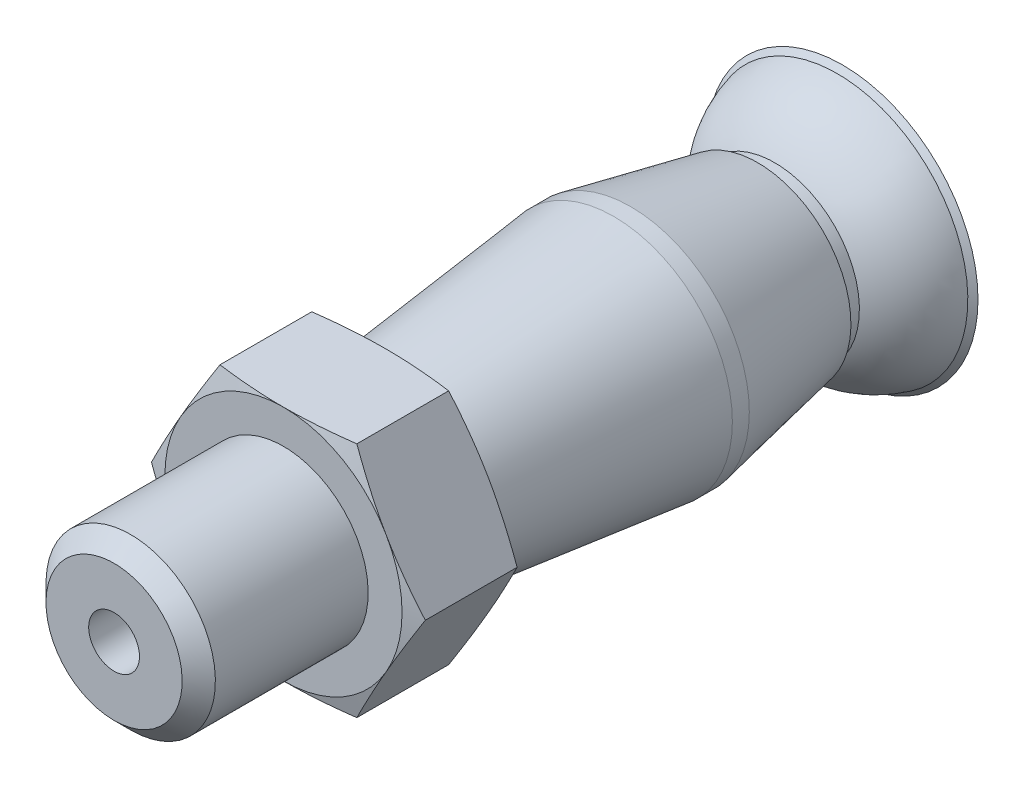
ISO-10303-21;
HEADER;
FILE_DESCRIPTION(('STEP AP214'),'2;1');
FILE_NAME('part.step','',(''),(''),'','','');
FILE_SCHEMA(('AUTOMOTIVE_DESIGN { 1 0 10303 214 1 1 1 1 }'));
ENDSEC;
DATA;
#1=APPLICATION_CONTEXT('core data for automotive mechanical design processes');
#2=APPLICATION_PROTOCOL_DEFINITION('international standard','automotive_design',2000,#1);
#3=PRODUCT_CONTEXT('',#1,'mechanical');
#4=PRODUCT('Part','Part','',(#3));
#5=PRODUCT_RELATED_PRODUCT_CATEGORY('part','',(#4));
#6=PRODUCT_DEFINITION_FORMATION('','',#4);
#7=PRODUCT_DEFINITION_CONTEXT('part definition',#1,'design');
#8=PRODUCT_DEFINITION('design','',#6,#7);
#9=PRODUCT_DEFINITION_SHAPE('','',#8);
#10=(LENGTH_UNIT() NAMED_UNIT(*) SI_UNIT(.MILLI.,.METRE.));
#11=(NAMED_UNIT(*) PLANE_ANGLE_UNIT() SI_UNIT($,.RADIAN.));
#12=(NAMED_UNIT(*) SI_UNIT($,.STERADIAN.) SOLID_ANGLE_UNIT());
#13=UNCERTAINTY_MEASURE_WITH_UNIT(LENGTH_MEASURE(1.E-05),#10,'distance_accuracy_value','');
#14=(GEOMETRIC_REPRESENTATION_CONTEXT(3) GLOBAL_UNCERTAINTY_ASSIGNED_CONTEXT((#13)) GLOBAL_UNIT_ASSIGNED_CONTEXT((#10,
#11,#12)) REPRESENTATION_CONTEXT('',''));
#15=CARTESIAN_POINT('',(0.,0.,0.));
#16=DIRECTION('',(0.,0.,1.));
#17=DIRECTION('',(1.,0.,0.));
#18=AXIS2_PLACEMENT_3D('',#15,#16,#17);
#19=CARTESIAN_POINT('',(4.04145188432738,0.,13.5));
#20=DIRECTION('',(0.866025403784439,0.5,0.));
#21=DIRECTION('',(0.,0.,1.));
#22=AXIS2_PLACEMENT_3D('',#19,#20,#21);
#23=PLANE('',#22);
#24=DIRECTION('',(0.,0.,1.));
#25=VECTOR('',#24,1.);
#26=CARTESIAN_POINT('',(2.02072594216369,3.5,13.5));
#27=LINE('',#26,#25);
#28=CARTESIAN_POINT('',(2.02072594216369,3.5,13.6450815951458));
#29=VERTEX_POINT('',#28);
#30=CARTESIAN_POINT('',(2.02072594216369,3.5,16.3549184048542));
#31=VERTEX_POINT('',#30);
#32=EDGE_CURVE('E10',#29,#31,#27,.T.);
#33=ORIENTED_EDGE('',*,*,#32,.T.);
#34=CARTESIAN_POINT('',(3.03108891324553,1.75,16.5));
#35=CARTESIAN_POINT('',(2.98902542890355,1.82280564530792,16.5000116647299));
#36=CARTESIAN_POINT('',(2.94693020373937,1.89559299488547,16.4992116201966));
#37=CARTESIAN_POINT('',(2.86298996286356,2.04077495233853,16.4960065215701));
#38=CARTESIAN_POINT('',(2.82114477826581,2.11316964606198,16.4936097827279));
#39=CARTESIAN_POINT('',(2.73737013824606,2.25832858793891,16.4872134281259));
#40=CARTESIAN_POINT('',(2.69544132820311,2.33109285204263,16.4832057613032));
#41=CARTESIAN_POINT('',(2.61100974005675,2.47762249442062,16.4736124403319));
#42=CARTESIAN_POINT('',(2.56850763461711,2.55138677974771,16.4680043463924));
#43=CARTESIAN_POINT('',(2.48458587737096,2.69678795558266,16.4555223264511));
#44=CARTESIAN_POINT('',(2.44316768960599,2.76842896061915,16.4486862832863));
#45=CARTESIAN_POINT('',(2.36002861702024,2.91228788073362,16.4336386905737));
#46=CARTESIAN_POINT('',(2.31830850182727,2.98450496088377,16.4254149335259));
#47=CARTESIAN_POINT('',(2.23432606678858,3.12993666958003,16.4076044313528));
#48=CARTESIAN_POINT('',(2.19206513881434,3.20314978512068,16.3979988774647));
#49=CARTESIAN_POINT('',(2.10676745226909,3.35093309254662,16.3774303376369));
#50=CARTESIAN_POINT('',(2.06373221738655,3.42550090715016,16.366443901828));
#51=CARTESIAN_POINT('',(2.02072594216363,3.49999999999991,16.3549184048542));
#52=B_SPLINE_CURVE_WITH_KNOTS('',3,(#34,#35,#36,#37,#38,#39,#40,#41,#42,#43,#44,#45,#46,#47,#48,
#49,#50,#51),.UNSPECIFIED.,.F.,.F.,(4,2,2,2,2,2,2,2,4),(0.,0.252245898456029,0.503188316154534,
0.755400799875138,1.01133970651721,1.26043079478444,1.51183973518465,1.76706814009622,
2.02743878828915),.UNSPECIFIED.);
#53=CARTESIAN_POINT('',(3.03108891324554,1.75,16.5));
#54=VERTEX_POINT('',#53);
#55=EDGE_CURVE('E264',#54,#31,#52,.T.);
#56=ORIENTED_EDGE('',*,*,#55,.F.);
#57=CARTESIAN_POINT('',(4.04145188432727,0.,16.3549184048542));
#58=CARTESIAN_POINT('',(3.99844077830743,0.0744874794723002,16.3664428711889));
#59=CARTESIAN_POINT('',(3.95538519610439,0.149034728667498,16.3774282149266));
#60=CARTESIAN_POINT('',(3.87005639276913,0.296788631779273,16.3979953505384));
#61=CARTESIAN_POINT('',(3.82778445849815,0.369992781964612,16.4076005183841));
#62=CARTESIAN_POINT('',(3.74382920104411,0.515440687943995,16.4254109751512));
#63=CARTESIAN_POINT('',(3.70214649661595,0.587682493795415,16.4336349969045));
#64=CARTESIAN_POINT('',(3.6191242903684,0.731620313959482,16.4486840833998));
#65=CARTESIAN_POINT('',(3.57778514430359,0.803315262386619,16.4555212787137));
#66=CARTESIAN_POINT('',(3.49382154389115,0.948691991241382,16.4680043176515));
#67=CARTESIAN_POINT('',(3.45119282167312,1.02237455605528,16.473612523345));
#68=CARTESIAN_POINT('',(3.36651390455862,1.16874991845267,16.4832059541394));
#69=CARTESIAN_POINT('',(3.3244642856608,1.24144157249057,16.4872135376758));
#70=CARTESIAN_POINT('',(3.24064160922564,1.3865727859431,16.4936098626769));
#71=CARTESIAN_POINT('',(3.19886821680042,1.45901179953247,16.4960065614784));
#72=CARTESIAN_POINT('',(3.11510360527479,1.6043066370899,16.4992116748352));
#73=CARTESIAN_POINT('',(3.07311239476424,1.67716265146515,16.5000116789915));
#74=CARTESIAN_POINT('',(3.03108891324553,1.75,16.5));
#75=B_SPLINE_CURVE_WITH_KNOTS('',3,(#57,#58,#59,#60,#61,#62,#63,#64,#65,#66,#67,#68,#69,#70,#71,
#72,#73,#74),.UNSPECIFIED.,.F.,.F.,(4,2,2,2,2,2,2,2,4),(0.,0.26034751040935,0.515569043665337,
0.76698615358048,1.01609904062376,1.27201562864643,1.52422066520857,1.77517053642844,
2.02743880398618),.UNSPECIFIED.);
#76=CARTESIAN_POINT('',(4.04145188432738,0.,16.3549184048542));
#77=VERTEX_POINT('',#76);
#78=EDGE_CURVE('E739',#77,#54,#75,.T.);
#79=ORIENTED_EDGE('',*,*,#78,.F.);
#80=DIRECTION('',(0.,0.,1.));
#81=VECTOR('',#80,1.);
#82=CARTESIAN_POINT('',(4.04145188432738,0.,13.5));
#83=LINE('',#82,#81);
#84=CARTESIAN_POINT('',(4.04145188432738,0.,13.6450815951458));
#85=VERTEX_POINT('',#84);
#86=EDGE_CURVE('E215',#85,#77,#83,.T.);
#87=ORIENTED_EDGE('',*,*,#86,.F.);
#88=CARTESIAN_POINT('',(3.03108891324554,1.75000000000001,13.5));
#89=CARTESIAN_POINT('',(3.07310870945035,1.67716913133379,13.4999883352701));
#90=CARTESIAN_POINT('',(3.11509679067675,1.60431992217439,13.5007883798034));
#91=CARTESIAN_POINT('',(3.19885793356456,1.45903456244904,13.5039934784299));
#92=CARTESIAN_POINT('',(3.24063098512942,1.38659822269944,13.5063902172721));
#93=CARTESIAN_POINT('',(3.32445499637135,1.24146778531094,13.5127865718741));
#94=CARTESIAN_POINT('',(3.36650629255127,1.16877423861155,13.5167942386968));
#95=CARTESIAN_POINT('',(3.45118889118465,1.02238951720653,13.5263875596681));
#96=CARTESIAN_POINT('',(3.49381958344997,0.948699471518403,13.5319956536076));
#97=CARTESIAN_POINT('',(3.5777798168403,0.803320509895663,13.5444776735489));
#98=CARTESIAN_POINT('',(3.61911365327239,0.731630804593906,13.5513137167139));
#99=CARTESIAN_POINT('',(3.70212959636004,0.587700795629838,13.5663613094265));
#100=CARTESIAN_POINT('',(3.74381136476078,0.515461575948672,13.5745850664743));
#101=CARTESIAN_POINT('',(3.82776770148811,0.370014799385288,13.5923955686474));
#102=CARTESIAN_POINT('',(3.87004165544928,0.296809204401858,13.6020011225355));
#103=CARTESIAN_POINT('',(3.9553769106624,0.149047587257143,13.6225696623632));
#104=CARTESIAN_POINT('',(3.9984369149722,0.0744940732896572,13.6335560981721));
#105=CARTESIAN_POINT('',(4.04145188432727,0.,13.6450815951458));
#106=B_SPLINE_CURVE_WITH_KNOTS('',3,(#88,#89,#90,#91,#92,#93,#94,#95,#96,#97,#98,#99,#100,#101,
#102,#103,#104,#105),.UNSPECIFIED.,.F.,.F.,(4,2,2,2,2,2,2,2,4),(0.,0.252245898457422,
0.503188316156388,0.75540079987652,1.01133970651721,1.2604307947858,1.51183973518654,
1.76706814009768,2.02743878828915),.UNSPECIFIED.);
#107=CARTESIAN_POINT('',(3.03108891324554,1.75,13.5));
#108=VERTEX_POINT('',#107);
#109=EDGE_CURVE('E738',#108,#85,#106,.T.);
#110=ORIENTED_EDGE('',*,*,#109,.F.);
#111=CARTESIAN_POINT('',(2.02072594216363,3.49999999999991,13.6450815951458));
#112=CARTESIAN_POINT('',(2.06372843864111,3.42550754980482,13.633557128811));
#113=CARTESIAN_POINT('',(2.10676045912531,3.35094669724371,13.6225717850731));
#114=CARTESIAN_POINT('',(2.19205469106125,3.20317283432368,13.6020046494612));
#115=CARTESIAN_POINT('',(2.23431537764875,3.1299621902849,13.5923994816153));
#116=CARTESIAN_POINT('',(2.31829933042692,2.98453085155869,13.5745890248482));
#117=CARTESIAN_POINT('',(2.3600212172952,2.91231166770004,13.566365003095));
#118=CARTESIAN_POINT('',(2.44316392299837,2.76844341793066,13.5513159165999));
#119=CARTESIAN_POINT('',(2.48458399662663,2.69679519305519,13.5444787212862));
#120=CARTESIAN_POINT('',(2.5685021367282,2.55139221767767,13.5319956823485));
#121=CARTESIAN_POINT('',(2.61099874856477,2.47763337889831,13.526387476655));
#122=CARTESIAN_POINT('',(2.69542407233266,2.33111160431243,13.5167940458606));
#123=CARTESIAN_POINT('',(2.73735208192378,2.25834973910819,13.5127864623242));
#124=CARTESIAN_POINT('',(2.82112806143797,2.11319156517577,13.5063901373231));
#125=CARTESIAN_POINT('',(2.86297539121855,2.04079523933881,13.5039934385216));
#126=CARTESIAN_POINT('',(2.94692210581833,1.89560553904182,13.5007883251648));
#127=CARTESIAN_POINT('',(2.98902165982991,1.82281207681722,13.4999883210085));
#128=CARTESIAN_POINT('',(3.03108891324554,1.75000000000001,13.5));
#129=B_SPLINE_CURVE_WITH_KNOTS('',3,(#111,#112,#113,#114,#115,#116,#117,#118,#119,#120,#121,
#122,#123,#124,#125,#126,#127,#128),.UNSPECIFIED.,.F.,.F.,(4,2,2,2,2,2,2,2,4),(0.,
0.260347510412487,0.515569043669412,0.766986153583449,1.01609904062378,1.27201562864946,
1.52422066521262,1.77517053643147,2.02743880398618),.UNSPECIFIED.);
#130=EDGE_CURVE('E348',#29,#108,#129,.T.);
#131=ORIENTED_EDGE('',*,*,#130,.F.);
#132=EDGE_LOOP('',(#33,#56,#79,#87,#110,#131));
#133=FACE_BOUND('',#132,.T.);
#134=ADVANCED_FACE('F15',(#133),#23,.T.);
#135=CARTESIAN_POINT('',(2.02072594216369,3.5,13.5));
#136=DIRECTION('',(0.,1.,0.));
#137=DIRECTION('',(-1.,0.,0.));
#138=AXIS2_PLACEMENT_3D('',#135,#136,#137);
#139=PLANE('',#138);
#140=DIRECTION('',(0.,0.,1.));
#141=VECTOR('',#140,1.);
#142=CARTESIAN_POINT('',(-2.02072594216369,3.5,13.5));
#143=LINE('',#142,#141);
#144=CARTESIAN_POINT('',(-2.02072594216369,3.5,13.6450815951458));
#145=VERTEX_POINT('',#144);
#146=CARTESIAN_POINT('',(-2.02072594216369,3.5,16.3549184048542));
#147=VERTEX_POINT('',#146);
#148=EDGE_CURVE('E29',#145,#147,#143,.T.);
#149=ORIENTED_EDGE('',*,*,#148,.T.);
#150=CARTESIAN_POINT('',(0.,3.5,16.5));
#151=CARTESIAN_POINT('',(-0.0840728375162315,3.49997473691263,16.5000116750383));
#152=CARTESIAN_POINT('',(-0.168145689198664,3.49991558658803,16.4992111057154));
#153=CARTESIAN_POINT('',(-0.335839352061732,3.4998202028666,16.4960044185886));
#154=CARTESIAN_POINT('',(-0.419460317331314,3.49978385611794,16.4936063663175));
#155=CARTESIAN_POINT('',(-0.587078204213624,3.49982281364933,16.4872068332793));
#156=CARTESIAN_POINT('',(-0.671074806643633,3.49989870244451,16.4831970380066));
#157=CARTESIAN_POINT('',(-0.840236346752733,3.5000505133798,16.4735990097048));
#158=CARTESIAN_POINT('',(-0.925399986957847,3.50012641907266,16.4679880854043));
#159=CARTESIAN_POINT('',(-1.09331763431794,3.50014693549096,16.455502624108));
#160=CARTESIAN_POINT('',(-1.17607450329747,3.50009504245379,16.4486663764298));
#161=CARTESIAN_POINT('',(-1.34222987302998,3.50001609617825,16.4336194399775));
#162=CARTESIAN_POINT('',(-1.42562727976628,3.49998927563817,16.4253966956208));
#163=CARTESIAN_POINT('',(-1.59354697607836,3.4999650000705,16.4075893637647));
#164=CARTESIAN_POINT('',(-1.67806727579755,3.49996799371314,16.3979861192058));
#165=CARTESIAN_POINT('',(-1.84866023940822,3.49998286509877,16.377423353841));
#166=CARTESIAN_POINT('',(-1.93473009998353,3.4999949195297,16.366440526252));
#167=CARTESIAN_POINT('',(-2.02072594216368,3.49999999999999,16.3549184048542));
#168=B_SPLINE_CURVE_WITH_KNOTS('',3,(#150,#151,#152,#153,#154,#155,#156,#157,#158,#159,#160,
#161,#162,#163,#164,#165,#166,#167),.UNSPECIFIED.,.F.,.F.,(4,2,2,2,2,2,2,2,4),(0.,
0.252214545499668,0.503165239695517,0.755427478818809,1.01145927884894,1.26056491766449,
1.51196020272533,1.76714435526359,2.02743811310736),.UNSPECIFIED.);
#169=CARTESIAN_POINT('',(0.,3.5,16.5));
#170=VERTEX_POINT('',#169);
#171=EDGE_CURVE('E801',#170,#147,#168,.T.);
#172=ORIENTED_EDGE('',*,*,#171,.F.);
#173=CARTESIAN_POINT('',(2.02072594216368,3.49999999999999,16.3549184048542));
#174=CARTESIAN_POINT('',(1.93507341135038,3.49999509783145,16.3663944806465));
#175=CARTESIAN_POINT('',(1.84934753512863,3.49998103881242,16.3773360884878));
#176=CARTESIAN_POINT('',(1.67943849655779,3.499959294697,16.3978276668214));
#177=CARTESIAN_POINT('',(1.59525811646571,3.49995148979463,16.4074007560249));
#178=CARTESIAN_POINT('',(1.42801967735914,3.49996475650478,16.4251589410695));
#179=CARTESIAN_POINT('',(1.34496360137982,3.49998539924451,16.4333626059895));
#180=CARTESIAN_POINT('',(1.17949867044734,3.50005183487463,16.4483826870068));
#181=CARTESIAN_POINT('',(1.09709091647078,3.50009739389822,16.4552112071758));
#182=CARTESIAN_POINT('',(0.929202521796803,3.50007091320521,16.4677431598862));
#183=CARTESIAN_POINT('',(0.843718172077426,3.49999457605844,16.4733971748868));
#184=CARTESIAN_POINT('',(0.6739058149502,3.49984878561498,16.4830689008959));
#185=CARTESIAN_POINT('',(0.589579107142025,3.49977924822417,16.4871092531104));
#186=CARTESIAN_POINT('',(0.421283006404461,3.49975539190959,16.4935578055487));
#187=CARTESIAN_POINT('',(0.33731392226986,3.49980050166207,16.4959740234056));
#188=CARTESIAN_POINT('',(0.168896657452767,3.49990992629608,16.4992053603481));
#189=CARTESIAN_POINT('',(0.0844483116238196,3.49997434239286,16.5000118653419));
#190=CARTESIAN_POINT('',(0.,3.5,16.5));
#191=B_SPLINE_CURVE_WITH_KNOTS('',3,(#173,#174,#175,#176,#177,#178,#179,#180,#181,#182,#183,
#184,#185,#186,#187,#188,#189,#190),.UNSPECIFIED.,.F.,.F.,(4,2,2,2,2,2,2,2,4),(0.,
0.259254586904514,0.513415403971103,0.763786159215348,1.01184626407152,1.2688464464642,
1.5221020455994,1.7740980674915,2.02743902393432),.UNSPECIFIED.);
#192=EDGE_CURVE('E223',#31,#170,#191,.T.);
#193=ORIENTED_EDGE('',*,*,#192,.F.);
#194=ORIENTED_EDGE('',*,*,#32,.F.);
#195=CARTESIAN_POINT('',(0.,3.5,13.5));
#196=CARTESIAN_POINT('',(0.0840728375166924,3.49997473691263,13.4999883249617));
#197=CARTESIAN_POINT('',(0.168145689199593,3.49991558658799,13.5007888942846));
#198=CARTESIAN_POINT('',(0.335839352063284,3.49982020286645,13.5039955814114));
#199=CARTESIAN_POINT('',(0.419460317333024,3.49978385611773,13.5063936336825));
#200=CARTESIAN_POINT('',(0.587078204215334,3.49982281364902,13.5127931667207));
#201=CARTESIAN_POINT('',(0.671074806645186,3.49989870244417,13.5168029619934));
#202=CARTESIAN_POINT('',(0.840236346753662,3.50005051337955,13.5264009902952));
#203=CARTESIAN_POINT('',(0.925399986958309,3.50012641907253,13.5320119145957));
#204=CARTESIAN_POINT('',(1.09331763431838,3.5001469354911,13.5444973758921));
#205=CARTESIAN_POINT('',(1.17607450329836,3.50009504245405,13.5513336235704));
#206=CARTESIAN_POINT('',(1.34222987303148,3.50001609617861,13.5663805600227));
#207=CARTESIAN_POINT('',(1.42562727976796,3.49998927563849,13.5746033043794));
#208=CARTESIAN_POINT('',(1.59354697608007,3.49996500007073,13.5924106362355));
#209=CARTESIAN_POINT('',(1.67806727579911,3.49996799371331,13.6020138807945));
#210=CARTESIAN_POINT('',(1.84866023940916,3.49998286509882,13.6225766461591));
#211=CARTESIAN_POINT('',(1.934730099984,3.49999491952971,13.6335594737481));
#212=CARTESIAN_POINT('',(2.02072594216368,3.5,13.6450815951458));
#213=B_SPLINE_CURVE_WITH_KNOTS('',3,(#195,#196,#197,#198,#199,#200,#201,#202,#203,#204,#205,
#206,#207,#208,#209,#210,#211,#212),.UNSPECIFIED.,.F.,.F.,(4,2,2,2,2,2,2,2,4),(0.,
0.25221454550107,0.50316523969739,0.755427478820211,1.01145927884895,1.26056491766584,
1.5119602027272,1.76714435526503,2.02743811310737),.UNSPECIFIED.);
#214=CARTESIAN_POINT('',(0.,3.5,13.5));
#215=VERTEX_POINT('',#214);
#216=EDGE_CURVE('E160',#215,#29,#213,.T.);
#217=ORIENTED_EDGE('',*,*,#216,.F.);
#218=CARTESIAN_POINT('',(-2.02072594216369,3.49999999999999,13.6450815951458));
#219=CARTESIAN_POINT('',(-1.93507341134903,3.49999509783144,13.6336055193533));
#220=CARTESIAN_POINT('',(-1.84934753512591,3.49998103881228,13.6226639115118));
#221=CARTESIAN_POINT('',(-1.67943849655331,3.49995929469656,13.602172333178));
#222=CARTESIAN_POINT('',(-1.59525811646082,3.49995148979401,13.5925992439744));
#223=CARTESIAN_POINT('',(-1.42801967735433,3.4999647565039,13.5748410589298));
#224=CARTESIAN_POINT('',(-1.34496360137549,3.49998539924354,13.5666373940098));
#225=CARTESIAN_POINT('',(-1.17949867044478,3.50005183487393,13.5516173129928));
#226=CARTESIAN_POINT('',(-1.0970909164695,3.50009739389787,13.544788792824));
#227=CARTESIAN_POINT('',(-0.929202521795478,3.50007091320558,13.5322568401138));
#228=CARTESIAN_POINT('',(-0.843718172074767,3.49999457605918,13.5266028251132));
#229=CARTESIAN_POINT('',(-0.673905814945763,3.49984878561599,13.5169310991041));
#230=CARTESIAN_POINT('',(-0.589579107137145,3.49977924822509,13.5128907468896));
#231=CARTESIAN_POINT('',(-0.421283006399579,3.49975539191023,13.5064421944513));
#232=CARTESIAN_POINT('',(-0.33731392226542,3.49980050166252,13.5040259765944));
#233=CARTESIAN_POINT('',(-0.1688966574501,3.49990992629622,13.5007946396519));
#234=CARTESIAN_POINT('',(-0.084448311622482,3.49997434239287,13.4999881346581));
#235=CARTESIAN_POINT('',(0.,3.5,13.5));
#236=B_SPLINE_CURVE_WITH_KNOTS('',3,(#218,#219,#220,#221,#222,#223,#224,#225,#226,#227,#228,
#229,#230,#231,#232,#233,#234,#235),.UNSPECIFIED.,.F.,.F.,(4,2,2,2,2,2,2,2,4),(0.,
0.259254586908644,0.513415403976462,0.763786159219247,1.01184626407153,1.2688464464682,
1.52210204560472,1.77409806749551,2.02743902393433),.UNSPECIFIED.);
#237=EDGE_CURVE('E307',#145,#215,#236,.T.);
#238=ORIENTED_EDGE('',*,*,#237,.F.);
#239=EDGE_LOOP('',(#149,#172,#193,#194,#217,#238));
#240=FACE_BOUND('',#239,.T.);
#241=ADVANCED_FACE('F17',(#240),#139,.T.);
#242=CARTESIAN_POINT('',(-2.02072594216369,3.5,13.5));
#243=DIRECTION('',(-0.866025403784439,0.5,0.));
#244=DIRECTION('',(0.,0.,-1.));
#245=AXIS2_PLACEMENT_3D('',#242,#243,#244);
#246=PLANE('',#245);
#247=DIRECTION('',(0.,0.,1.));
#248=VECTOR('',#247,1.);
#249=CARTESIAN_POINT('',(-4.04145188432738,0.,13.5));
#250=LINE('',#249,#248);
#251=CARTESIAN_POINT('',(-4.04145188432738,0.,13.6450815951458));
#252=VERTEX_POINT('',#251);
#253=CARTESIAN_POINT('',(-4.04145188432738,0.,16.3549184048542));
#254=VERTEX_POINT('',#253);
#255=EDGE_CURVE('E578',#252,#254,#250,.T.);
#256=ORIENTED_EDGE('',*,*,#255,.T.);
#257=CARTESIAN_POINT('',(-3.03108891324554,1.75,16.5));
#258=CARTESIAN_POINT('',(-3.07310870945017,1.67716913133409,16.5000116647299));
#259=CARTESIAN_POINT('',(-3.11509679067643,1.60431992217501,16.4992116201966));
#260=CARTESIAN_POINT('',(-3.19885793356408,1.45903456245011,16.4960065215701));
#261=CARTESIAN_POINT('',(-3.24063098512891,1.38659822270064,16.4936097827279));
#262=CARTESIAN_POINT('',(-3.3244549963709,1.24146778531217,16.4872134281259));
#263=CARTESIAN_POINT('',(-3.36650629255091,1.16877423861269,16.4832057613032));
#264=CARTESIAN_POINT('',(-3.45118889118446,1.02238951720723,16.4736124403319));
#265=CARTESIAN_POINT('',(-3.49381958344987,0.948699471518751,16.4680043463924));
#266=CARTESIAN_POINT('',(-3.57777981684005,0.803320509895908,16.4555223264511));
#267=CARTESIAN_POINT('',(-3.61911365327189,0.731630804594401,16.4486862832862));
#268=CARTESIAN_POINT('',(-3.70212959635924,0.587700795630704,16.4336386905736));
#269=CARTESIAN_POINT('',(-3.74381136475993,0.515461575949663,16.4254149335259));
#270=CARTESIAN_POINT('',(-3.82776770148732,0.370014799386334,16.4076044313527));
#271=CARTESIAN_POINT('',(-3.87004165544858,0.296809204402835,16.3979988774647));
#272=CARTESIAN_POINT('',(-3.955376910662,0.149047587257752,16.3774303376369));
#273=CARTESIAN_POINT('',(-3.99843691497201,0.0744940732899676,16.366443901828));
#274=CARTESIAN_POINT('',(-4.04145188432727,0.,16.3549184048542));
#275=B_SPLINE_CURVE_WITH_KNOTS('',3,(#257,#258,#259,#260,#261,#262,#263,#264,#265,#266,#267,
#268,#269,#270,#271,#272,#273,#274),.UNSPECIFIED.,.F.,.F.,(4,2,2,2,2,2,2,2,4),(0.,
0.252245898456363,0.503188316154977,0.755400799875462,1.0113397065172,1.26043079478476,
1.51183973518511,1.76706814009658,2.02743878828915),.UNSPECIFIED.);
#276=CARTESIAN_POINT('',(-3.03108891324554,1.75,16.5));
#277=VERTEX_POINT('',#276);
#278=EDGE_CURVE('E583',#277,#254,#275,.T.);
#279=ORIENTED_EDGE('',*,*,#278,.F.);
#280=CARTESIAN_POINT('',(-2.02072594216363,3.4999999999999,16.3549184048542));
#281=CARTESIAN_POINT('',(-2.06372843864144,3.42550754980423,16.3664428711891));
#282=CARTESIAN_POINT('',(-2.10676045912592,3.35094669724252,16.3774282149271));
#283=CARTESIAN_POINT('',(-2.19205469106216,3.20317283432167,16.3979953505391));
#284=CARTESIAN_POINT('',(-2.23431537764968,3.12996219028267,16.407600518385));
#285=CARTESIAN_POINT('',(-2.31829933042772,2.98453085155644,16.4254109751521));
#286=CARTESIAN_POINT('',(-2.36002121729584,2.91231166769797,16.4336349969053));
#287=CARTESIAN_POINT('',(-2.44316392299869,2.7684434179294,16.4486840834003));
#288=CARTESIAN_POINT('',(-2.48458399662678,2.69679519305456,16.4555212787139));
#289=CARTESIAN_POINT('',(-2.56850213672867,2.5513922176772,16.4680043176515));
#290=CARTESIAN_POINT('',(-2.61099874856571,2.47763337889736,16.473612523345));
#291=CARTESIAN_POINT('',(-2.69542407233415,2.3311116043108,16.4832059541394));
#292=CARTESIAN_POINT('',(-2.73735208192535,2.25834973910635,16.4872135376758));
#293=CARTESIAN_POINT('',(-2.82112806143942,2.11319156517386,16.4936098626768));
#294=CARTESIAN_POINT('',(-2.86297539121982,2.04079523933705,16.4960065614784));
#295=CARTESIAN_POINT('',(-2.94692210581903,1.89560553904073,16.4992116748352));
#296=CARTESIAN_POINT('',(-2.98902165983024,1.82281207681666,16.5000116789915));
#297=CARTESIAN_POINT('',(-3.03108891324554,1.75,16.5));
#298=B_SPLINE_CURVE_WITH_KNOTS('',3,(#280,#281,#282,#283,#284,#285,#286,#287,#288,#289,#290,
#291,#292,#293,#294,#295,#296,#297),.UNSPECIFIED.,.F.,.F.,(4,2,2,2,2,2,2,2,4),(0.,
0.260347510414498,0.515569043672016,0.76698615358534,1.01609904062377,1.2720156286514,
1.5242206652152,1.77517053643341,2.02743880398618),.UNSPECIFIED.);
#299=EDGE_CURVE('E796',#147,#277,#298,.T.);
#300=ORIENTED_EDGE('',*,*,#299,.F.);
#301=ORIENTED_EDGE('',*,*,#148,.F.);
#302=CARTESIAN_POINT('',(-3.03108891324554,1.75,13.5));
#303=CARTESIAN_POINT('',(-2.98902542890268,1.82280564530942,13.4999883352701));
#304=CARTESIAN_POINT('',(-2.94693020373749,1.89559299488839,13.5007883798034));
#305=CARTESIAN_POINT('',(-2.86298996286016,2.04077495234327,13.5039934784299));
#306=CARTESIAN_POINT('',(-2.82114477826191,2.1131696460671,13.5063902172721));
#307=CARTESIAN_POINT('',(-2.73737013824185,2.25832858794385,13.5127865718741));
#308=CARTESIAN_POINT('',(-2.69544132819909,2.33109285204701,13.5167942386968));
#309=CARTESIAN_POINT('',(-2.61100974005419,2.47762249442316,13.5263875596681));
#310=CARTESIAN_POINT('',(-2.56850763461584,2.55138677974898,13.5319956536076));
#311=CARTESIAN_POINT('',(-2.48458587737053,2.69678795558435,13.5444776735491));
#312=CARTESIAN_POINT('',(-2.44316768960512,2.76842896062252,13.5513137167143));
#313=CARTESIAN_POINT('',(-2.36002861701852,2.91228788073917,13.5663613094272));
#314=CARTESIAN_POINT('',(-2.31830850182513,2.98450496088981,13.574585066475));
#315=CARTESIAN_POINT('',(-2.23432606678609,3.12993666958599,13.5923955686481));
#316=CARTESIAN_POINT('',(-2.19206513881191,3.20314978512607,13.6020011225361));
#317=CARTESIAN_POINT('',(-2.10676745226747,3.3509330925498,13.6225696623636));
#318=CARTESIAN_POINT('',(-2.06373221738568,3.42550090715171,13.6335560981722));
#319=CARTESIAN_POINT('',(-2.02072594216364,3.49999999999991,13.6450815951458));
#320=B_SPLINE_CURVE_WITH_KNOTS('',3,(#302,#303,#304,#305,#306,#307,#308,#309,#310,#311,#312,
#313,#314,#315,#316,#317,#318,#319),.UNSPECIFIED.,.F.,.F.,(4,2,2,2,2,2,2,2,4),(0.,
0.252245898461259,0.503188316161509,0.755400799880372,1.01133970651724,1.26043079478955,
1.51183973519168,1.76706814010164,2.02743878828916),.UNSPECIFIED.);
#321=CARTESIAN_POINT('',(-3.03108891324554,1.75,13.5));
#322=VERTEX_POINT('',#321);
#323=EDGE_CURVE('E684',#322,#145,#320,.T.);
#324=ORIENTED_EDGE('',*,*,#323,.F.);
#325=CARTESIAN_POINT('',(-4.04145188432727,0.,13.6450815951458));
#326=CARTESIAN_POINT('',(-3.99844077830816,0.0744874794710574,13.6335571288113));
#327=CARTESIAN_POINT('',(-3.95538519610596,0.149034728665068,13.6225717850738));
#328=CARTESIAN_POINT('',(-3.87005639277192,0.296788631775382,13.6020046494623));
#329=CARTESIAN_POINT('',(-3.82778445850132,0.369992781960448,13.5923994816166));
#330=CARTESIAN_POINT('',(-3.74382920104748,0.515440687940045,13.5745890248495));
#331=CARTESIAN_POINT('',(-3.70214649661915,0.587682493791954,13.5663650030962));
#332=CARTESIAN_POINT('',(-3.61912429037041,0.731620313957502,13.5513159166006));
#333=CARTESIAN_POINT('',(-3.5777851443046,0.803315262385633,13.5444787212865));
#334=CARTESIAN_POINT('',(-3.49382154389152,0.948691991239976,13.5319956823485));
#335=CARTESIAN_POINT('',(-3.45119282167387,1.02237455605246,13.526387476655));
#336=CARTESIAN_POINT('',(-3.36651390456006,1.16874991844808,13.5167940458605));
#337=CARTESIAN_POINT('',(-3.32446428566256,1.24144157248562,13.5127864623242));
#338=CARTESIAN_POINT('',(-3.24064160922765,1.38657278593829,13.5063901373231));
#339=CARTESIAN_POINT('',(-3.19886821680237,1.45901179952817,13.5039934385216));
#340=CARTESIAN_POINT('',(-3.11510360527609,1.60430663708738,13.5007883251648));
#341=CARTESIAN_POINT('',(-3.07311239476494,1.67716265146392,13.4999883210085));
#342=CARTESIAN_POINT('',(-3.03108891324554,1.75,13.5));
#343=B_SPLINE_CURVE_WITH_KNOTS('',3,(#325,#326,#327,#328,#329,#330,#331,#332,#333,#334,#335,
#336,#337,#338,#339,#340,#341,#342),.UNSPECIFIED.,.F.,.F.,(4,2,2,2,2,2,2,2,4),(0.,
0.260347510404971,0.515569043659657,0.766986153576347,1.01609904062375,1.2720156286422,
1.52422066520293,1.77517053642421,2.02743880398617),.UNSPECIFIED.);
#344=EDGE_CURVE('E650',#252,#322,#343,.T.);
#345=ORIENTED_EDGE('',*,*,#344,.F.);
#346=EDGE_LOOP('',(#256,#279,#300,#301,#324,#345));
#347=FACE_BOUND('',#346,.T.);
#348=ADVANCED_FACE('F366',(#347),#246,.T.);
#349=CARTESIAN_POINT('',(-4.04145188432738,0.,13.5));
#350=DIRECTION('',(-0.866025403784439,-0.5,0.));
#351=DIRECTION('',(0.,0.,-1.));
#352=AXIS2_PLACEMENT_3D('',#349,#350,#351);
#353=PLANE('',#352);
#354=DIRECTION('',(0.,0.,1.));
#355=VECTOR('',#354,1.);
#356=CARTESIAN_POINT('',(-2.02072594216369,-3.5,13.5));
#357=LINE('',#356,#355);
#358=CARTESIAN_POINT('',(-2.02072594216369,-3.5,13.6450815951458));
#359=VERTEX_POINT('',#358);
#360=CARTESIAN_POINT('',(-2.02072594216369,-3.5,16.3549184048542));
#361=VERTEX_POINT('',#360);
#362=EDGE_CURVE('E529',#359,#361,#357,.T.);
#363=ORIENTED_EDGE('',*,*,#362,.T.);
#364=CARTESIAN_POINT('',(-3.03108891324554,-1.74999999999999,16.5));
#365=CARTESIAN_POINT('',(-2.98902542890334,-1.82280564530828,16.5000116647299));
#366=CARTESIAN_POINT('',(-2.94693020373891,-1.89559299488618,16.4992116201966));
#367=CARTESIAN_POINT('',(-2.86298996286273,-2.04077495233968,16.4960065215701));
#368=CARTESIAN_POINT('',(-2.82114477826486,-2.11316964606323,16.4936097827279));
#369=CARTESIAN_POINT('',(-2.73737013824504,-2.25832858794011,16.4872134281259));
#370=CARTESIAN_POINT('',(-2.69544132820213,-2.3310928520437,16.4832057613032));
#371=CARTESIAN_POINT('',(-2.61100974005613,-2.47762249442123,16.4736124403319));
#372=CARTESIAN_POINT('',(-2.5685076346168,-2.55138677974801,16.4680043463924));
#373=CARTESIAN_POINT('',(-2.48458587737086,-2.69678795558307,16.4555223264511));
#374=CARTESIAN_POINT('',(-2.44316768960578,-2.76842896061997,16.4486862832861));
#375=CARTESIAN_POINT('',(-2.36002861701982,-2.91228788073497,16.4336386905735));
#376=CARTESIAN_POINT('',(-2.31830850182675,-2.98450496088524,16.4254149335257));
#377=CARTESIAN_POINT('',(-2.23432606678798,-3.12993666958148,16.4076044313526));
#378=CARTESIAN_POINT('',(-2.19206513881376,-3.20314978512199,16.3979988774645));
#379=CARTESIAN_POINT('',(-2.1067674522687,-3.35093309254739,16.3774303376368));
#380=CARTESIAN_POINT('',(-2.06373221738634,-3.42550090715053,16.3664439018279));
#381=CARTESIAN_POINT('',(-2.02072594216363,-3.4999999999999,16.3549184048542));
#382=B_SPLINE_CURVE_WITH_KNOTS('',3,(#364,#365,#366,#367,#368,#369,#370,#371,#372,#373,#374,
#375,#376,#377,#378,#379,#380,#381),.UNSPECIFIED.,.F.,.F.,(4,2,2,2,2,2,2,2,4),(0.,
0.252245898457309,0.503188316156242,0.755400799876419,1.01133970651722,1.26043079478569,
1.51183973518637,1.76706814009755,2.02743878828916),.UNSPECIFIED.);
#383=CARTESIAN_POINT('',(-3.03108891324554,-1.75,16.5));
#384=VERTEX_POINT('',#383);
#385=EDGE_CURVE('E561',#384,#361,#382,.T.);
#386=ORIENTED_EDGE('',*,*,#385,.F.);
#387=CARTESIAN_POINT('',(-4.04145188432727,0.,16.3549184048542));
#388=CARTESIAN_POINT('',(-3.99844077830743,-0.0744874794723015,16.3664428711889));
#389=CARTESIAN_POINT('',(-3.95538519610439,-0.149034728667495,16.3774282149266));
#390=CARTESIAN_POINT('',(-3.87005639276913,-0.296788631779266,16.3979953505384));
#391=CARTESIAN_POINT('',(-3.82778445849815,-0.369992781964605,16.4076005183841));
#392=CARTESIAN_POINT('',(-3.74382920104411,-0.515440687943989,16.4254109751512));
#393=CARTESIAN_POINT('',(-3.70214649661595,-0.587682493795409,16.4336349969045));
#394=CARTESIAN_POINT('',(-3.6191242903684,-0.731620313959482,16.4486840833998));
#395=CARTESIAN_POINT('',(-3.57778514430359,-0.803315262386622,16.4555212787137));
#396=CARTESIAN_POINT('',(-3.49382154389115,-0.948691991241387,16.4680043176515));
#397=CARTESIAN_POINT('',(-3.45119282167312,-1.02237455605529,16.473612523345));
#398=CARTESIAN_POINT('',(-3.36651390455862,-1.16874991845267,16.4832059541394));
#399=CARTESIAN_POINT('',(-3.3244642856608,-1.24144157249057,16.4872135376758));
#400=CARTESIAN_POINT('',(-3.24064160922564,-1.3865727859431,16.4936098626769));
#401=CARTESIAN_POINT('',(-3.19886821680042,-1.45901179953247,16.4960065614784));
#402=CARTESIAN_POINT('',(-3.1151036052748,-1.60430663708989,16.4992116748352));
#403=CARTESIAN_POINT('',(-3.07311239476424,-1.67716265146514,16.5000116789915));
#404=CARTESIAN_POINT('',(-3.03108891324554,-1.74999999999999,16.5));
#405=B_SPLINE_CURVE_WITH_KNOTS('',3,(#387,#388,#389,#390,#391,#392,#393,#394,#395,#396,#397,
#398,#399,#400,#401,#402,#403,#404),.UNSPECIFIED.,.F.,.F.,(4,2,2,2,2,2,2,2,4),(0.,
0.26034751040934,0.515569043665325,0.766986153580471,1.01609904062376,1.27201562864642,
1.52422066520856,1.77517053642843,2.02743880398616),.UNSPECIFIED.);
#406=EDGE_CURVE('E569',#254,#384,#405,.T.);
#407=ORIENTED_EDGE('',*,*,#406,.F.);
#408=ORIENTED_EDGE('',*,*,#255,.F.);
#409=CARTESIAN_POINT('',(-3.03108891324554,-1.75,13.5));
#410=CARTESIAN_POINT('',(-3.07310870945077,-1.67716913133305,13.4999883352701));
#411=CARTESIAN_POINT('',(-3.11509679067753,-1.60431992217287,13.5007883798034));
#412=CARTESIAN_POINT('',(-3.19885793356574,-1.45903456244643,13.5039934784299));
#413=CARTESIAN_POINT('',(-3.24063098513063,-1.38659822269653,13.5063902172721));
#414=CARTESIAN_POINT('',(-3.32445499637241,-1.24146778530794,13.5127865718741));
#415=CARTESIAN_POINT('',(-3.36650629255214,-1.16877423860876,13.5167942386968));
#416=CARTESIAN_POINT('',(-3.4511888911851,-1.02238951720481,13.5263875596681));
#417=CARTESIAN_POINT('',(-3.4938195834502,-0.948699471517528,13.5319956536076));
#418=CARTESIAN_POINT('',(-3.57777981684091,-0.803320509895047,13.5444776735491));
#419=CARTESIAN_POINT('',(-3.61911365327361,-0.731630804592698,13.5513137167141));
#420=CARTESIAN_POINT('',(-3.70212959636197,-0.587700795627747,13.566361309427));
#421=CARTESIAN_POINT('',(-3.74381136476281,-0.51546157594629,13.5745850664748));
#422=CARTESIAN_POINT('',(-3.82776770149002,-0.370014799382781,13.5923955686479));
#423=CARTESIAN_POINT('',(-3.87004165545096,-0.296809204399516,13.6020011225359));
#424=CARTESIAN_POINT('',(-3.95537691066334,-0.149047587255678,13.6225696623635));
#425=CARTESIAN_POINT('',(-3.99843691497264,-0.0744940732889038,13.6335560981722));
#426=CARTESIAN_POINT('',(-4.04145188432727,0.,13.6450815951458));
#427=B_SPLINE_CURVE_WITH_KNOTS('',3,(#409,#410,#411,#412,#413,#414,#415,#416,#417,#418,#419,
#420,#421,#422,#423,#424,#425,#426),.UNSPECIFIED.,.F.,.F.,(4,2,2,2,2,2,2,2,4),(0.,
0.252245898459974,0.503188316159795,0.755400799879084,1.01133970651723,1.2604307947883,
1.51183973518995,1.76706814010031,2.02743878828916),.UNSPECIFIED.);
#428=CARTESIAN_POINT('',(-3.03108891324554,-1.75,13.5));
#429=VERTEX_POINT('',#428);
#430=EDGE_CURVE('E642',#429,#252,#427,.T.);
#431=ORIENTED_EDGE('',*,*,#430,.F.);
#432=CARTESIAN_POINT('',(-2.02072594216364,-3.49999999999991,13.6450815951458));
#433=CARTESIAN_POINT('',(-2.06372843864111,-3.42550754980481,13.633557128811));
#434=CARTESIAN_POINT('',(-2.10676045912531,-3.35094669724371,13.6225717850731));
#435=CARTESIAN_POINT('',(-2.19205469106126,-3.20317283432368,13.6020046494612));
#436=CARTESIAN_POINT('',(-2.23431537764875,-3.1299621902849,13.5923994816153));
#437=CARTESIAN_POINT('',(-2.31829933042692,-2.98453085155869,13.5745890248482));
#438=CARTESIAN_POINT('',(-2.3600212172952,-2.91231166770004,13.566365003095));
#439=CARTESIAN_POINT('',(-2.44316392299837,-2.76844341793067,13.5513159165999));
#440=CARTESIAN_POINT('',(-2.48458399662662,-2.6967951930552,13.5444787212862));
#441=CARTESIAN_POINT('',(-2.5685021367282,-2.55139221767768,13.5319956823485));
#442=CARTESIAN_POINT('',(-2.61099874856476,-2.47763337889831,13.526387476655));
#443=CARTESIAN_POINT('',(-2.69542407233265,-2.33111160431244,13.5167940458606));
#444=CARTESIAN_POINT('',(-2.73735208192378,-2.2583497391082,13.5127864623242));
#445=CARTESIAN_POINT('',(-2.82112806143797,-2.11319156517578,13.5063901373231));
#446=CARTESIAN_POINT('',(-2.86297539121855,-2.04079523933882,13.5039934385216));
#447=CARTESIAN_POINT('',(-2.94692210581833,-1.89560553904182,13.5007883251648));
#448=CARTESIAN_POINT('',(-2.98902165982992,-1.82281207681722,13.4999883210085));
#449=CARTESIAN_POINT('',(-3.03108891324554,-1.75,13.5));
#450=B_SPLINE_CURVE_WITH_KNOTS('',3,(#432,#433,#434,#435,#436,#437,#438,#439,#440,#441,#442,
#443,#444,#445,#446,#447,#448,#449),.UNSPECIFIED.,.F.,.F.,(4,2,2,2,2,2,2,2,4),(0.,
0.260347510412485,0.515569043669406,0.766986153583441,1.01609904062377,1.27201562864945,
1.5242206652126,1.77517053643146,2.02743880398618),.UNSPECIFIED.);
#451=EDGE_CURVE('E406',#359,#429,#450,.T.);
#452=ORIENTED_EDGE('',*,*,#451,.F.);
#453=EDGE_LOOP('',(#363,#386,#407,#408,#431,#452));
#454=FACE_BOUND('',#453,.T.);
#455=ADVANCED_FACE('F355',(#454),#353,.T.);
#456=CARTESIAN_POINT('',(-2.02072594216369,-3.5,13.5));
#457=DIRECTION('',(0.,-1.,0.));
#458=DIRECTION('',(0.,0.,-1.));
#459=AXIS2_PLACEMENT_3D('',#456,#457,#458);
#460=PLANE('',#459);
#461=DIRECTION('',(0.,0.,1.));
#462=VECTOR('',#461,1.);
#463=CARTESIAN_POINT('',(2.02072594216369,-3.5,13.5));
#464=LINE('',#463,#462);
#465=CARTESIAN_POINT('',(2.02072594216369,-3.5,13.6450815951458));
#466=VERTEX_POINT('',#465);
#467=CARTESIAN_POINT('',(2.02072594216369,-3.5,16.3549184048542));
#468=VERTEX_POINT('',#467);
#469=EDGE_CURVE('E521',#466,#468,#464,.T.);
#470=ORIENTED_EDGE('',*,*,#469,.T.);
#471=CARTESIAN_POINT('',(0.,-3.5,16.5));
#472=CARTESIAN_POINT('',(0.0840728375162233,-3.49997473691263,16.5000116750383));
#473=CARTESIAN_POINT('',(0.168145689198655,-3.49991558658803,16.4992111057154));
#474=CARTESIAN_POINT('',(0.335839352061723,-3.4998202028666,16.4960044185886));
#475=CARTESIAN_POINT('',(0.419460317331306,-3.49978385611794,16.4936063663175));
#476=CARTESIAN_POINT('',(0.587078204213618,-3.49982281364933,16.4872068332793));
#477=CARTESIAN_POINT('',(0.671074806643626,-3.49989870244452,16.4831970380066));
#478=CARTESIAN_POINT('',(0.840236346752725,-3.5000505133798,16.4735990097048));
#479=CARTESIAN_POINT('',(0.92539998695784,-3.50012641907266,16.4679880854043));
#480=CARTESIAN_POINT('',(1.09331763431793,-3.50014693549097,16.455502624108));
#481=CARTESIAN_POINT('',(1.17607450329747,-3.50009504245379,16.4486663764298));
#482=CARTESIAN_POINT('',(1.34222987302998,-3.50001609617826,16.4336194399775));
#483=CARTESIAN_POINT('',(1.42562727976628,-3.49998927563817,16.4253966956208));
#484=CARTESIAN_POINT('',(1.59354697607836,-3.4999650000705,16.4075893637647));
#485=CARTESIAN_POINT('',(1.67806727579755,-3.49996799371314,16.3979861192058));
#486=CARTESIAN_POINT('',(1.84866023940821,-3.49998286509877,16.377423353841));
#487=CARTESIAN_POINT('',(1.93473009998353,-3.4999949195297,16.366440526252));
#488=CARTESIAN_POINT('',(2.02072594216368,-3.49999999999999,16.3549184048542));
#489=B_SPLINE_CURVE_WITH_KNOTS('',3,(#471,#472,#473,#474,#475,#476,#477,#478,#479,#480,#481,
#482,#483,#484,#485,#486,#487,#488),.UNSPECIFIED.,.F.,.F.,(4,2,2,2,2,2,2,2,4),(0.,
0.252214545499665,0.503165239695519,0.755427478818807,1.01145927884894,1.26056491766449,
1.51196020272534,1.7671443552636,2.02743811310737),.UNSPECIFIED.);
#490=CARTESIAN_POINT('',(0.,-3.5,16.5));
#491=VERTEX_POINT('',#490);
#492=EDGE_CURVE('E538',#491,#468,#489,.T.);
#493=ORIENTED_EDGE('',*,*,#492,.F.);
#494=CARTESIAN_POINT('',(-2.02072594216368,-3.49999999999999,16.3549184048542));
#495=CARTESIAN_POINT('',(-1.93507341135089,-3.49999509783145,16.3663944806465));
#496=CARTESIAN_POINT('',(-1.84934753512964,-3.49998103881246,16.3773360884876));
#497=CARTESIAN_POINT('',(-1.67943849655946,-3.49995929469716,16.3978276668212));
#498=CARTESIAN_POINT('',(-1.59525811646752,-3.49995148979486,16.4074007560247));
#499=CARTESIAN_POINT('',(-1.42801967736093,-3.49996475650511,16.4251589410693));
#500=CARTESIAN_POINT('',(-1.34496360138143,-3.49998539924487,16.4333626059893));
#501=CARTESIAN_POINT('',(-1.1794986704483,-3.50005183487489,16.4483826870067));
#502=CARTESIAN_POINT('',(-1.09709091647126,-3.50009739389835,16.4552112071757));
#503=CARTESIAN_POINT('',(-0.929202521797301,-3.50007091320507,16.4677431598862));
#504=CARTESIAN_POINT('',(-0.843718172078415,-3.49999457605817,16.4733971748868));
#505=CARTESIAN_POINT('',(-0.673905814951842,-3.49984878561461,16.4830689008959));
#506=CARTESIAN_POINT('',(-0.58957910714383,-3.49977924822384,16.4871092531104));
#507=CARTESIAN_POINT('',(-0.421283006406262,-3.49975539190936,16.4935578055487));
#508=CARTESIAN_POINT('',(-0.337313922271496,-3.49980050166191,16.4959740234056));
#509=CARTESIAN_POINT('',(-0.168896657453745,-3.49990992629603,16.4992053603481));
#510=CARTESIAN_POINT('',(-0.0844483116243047,-3.49997434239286,16.5000118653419));
#511=CARTESIAN_POINT('',(0.,-3.5,16.5));
#512=B_SPLINE_CURVE_WITH_KNOTS('',3,(#494,#495,#496,#497,#498,#499,#500,#501,#502,#503,#504,
#505,#506,#507,#508,#509,#510,#511),.UNSPECIFIED.,.F.,.F.,(4,2,2,2,2,2,2,2,4),(0.,
0.259254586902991,0.51341540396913,0.76378615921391,1.01184626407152,1.26884644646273,
1.52210204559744,1.77409806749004,2.02743902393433),.UNSPECIFIED.);
#513=EDGE_CURVE('E778',#361,#491,#512,.T.);
#514=ORIENTED_EDGE('',*,*,#513,.F.);
#515=ORIENTED_EDGE('',*,*,#362,.F.);
#516=CARTESIAN_POINT('',(0.,-3.5,13.5));
#517=CARTESIAN_POINT('',(-0.0840728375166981,-3.49997473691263,13.4999883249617));
#518=CARTESIAN_POINT('',(-0.168145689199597,-3.49991558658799,13.5007888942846));
#519=CARTESIAN_POINT('',(-0.335839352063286,-3.49982020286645,13.5039955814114));
#520=CARTESIAN_POINT('',(-0.419460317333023,-3.49978385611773,13.5063936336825));
#521=CARTESIAN_POINT('',(-0.587078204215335,-3.49982281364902,13.5127931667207));
#522=CARTESIAN_POINT('',(-0.67107480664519,-3.49989870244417,13.5168029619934));
#523=CARTESIAN_POINT('',(-0.840236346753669,-3.50005051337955,13.5264009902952));
#524=CARTESIAN_POINT('',(-0.925399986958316,-3.50012641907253,13.5320119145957));
#525=CARTESIAN_POINT('',(-1.09331763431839,-3.50014693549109,13.5444973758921));
#526=CARTESIAN_POINT('',(-1.17607450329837,-3.50009504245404,13.5513336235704));
#527=CARTESIAN_POINT('',(-1.34222987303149,-3.5000160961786,13.5663805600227));
#528=CARTESIAN_POINT('',(-1.42562727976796,-3.49998927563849,13.5746033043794));
#529=CARTESIAN_POINT('',(-1.59354697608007,-3.49996500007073,13.5924106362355));
#530=CARTESIAN_POINT('',(-1.67806727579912,-3.4999679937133,13.6020138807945));
#531=CARTESIAN_POINT('',(-1.84866023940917,-3.49998286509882,13.6225766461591));
#532=CARTESIAN_POINT('',(-1.93473009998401,-3.49999491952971,13.6335594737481));
#533=CARTESIAN_POINT('',(-2.02072594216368,-3.49999999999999,13.6450815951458));
#534=B_SPLINE_CURVE_WITH_KNOTS('',3,(#516,#517,#518,#519,#520,#521,#522,#523,#524,#525,#526,
#527,#528,#529,#530,#531,#532,#533),.UNSPECIFIED.,.F.,.F.,(4,2,2,2,2,2,2,2,4),(0.,
0.252214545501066,0.503165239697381,0.755427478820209,1.01145927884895,1.26056491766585,
1.5119602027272,1.76714435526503,2.02743811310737),.UNSPECIFIED.);
#535=CARTESIAN_POINT('',(0.,-3.5,13.5));
#536=VERTEX_POINT('',#535);
#537=EDGE_CURVE('E396',#536,#359,#534,.T.);
#538=ORIENTED_EDGE('',*,*,#537,.F.);
#539=CARTESIAN_POINT('',(2.02072594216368,-3.5,13.6450815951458));
#540=CARTESIAN_POINT('',(1.9350734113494,-3.49999509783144,13.6336055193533));
#541=CARTESIAN_POINT('',(1.84934753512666,-3.49998103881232,13.6226639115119));
#542=CARTESIAN_POINT('',(1.67943849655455,-3.49995929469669,13.6021723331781));
#543=CARTESIAN_POINT('',(1.59525811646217,-3.49995148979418,13.5925992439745));
#544=CARTESIAN_POINT('',(1.42801967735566,-3.49996475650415,13.5748410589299));
#545=CARTESIAN_POINT('',(1.34496360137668,-3.49998539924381,13.56663739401));
#546=CARTESIAN_POINT('',(1.17949867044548,-3.50005183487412,13.5516173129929));
#547=CARTESIAN_POINT('',(1.09709091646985,-3.50009739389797,13.5447887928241));
#548=CARTESIAN_POINT('',(0.929202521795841,-3.50007091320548,13.5322568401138));
#549=CARTESIAN_POINT('',(0.8437181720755,-3.49999457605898,13.5266028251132));
#550=CARTESIAN_POINT('',(0.67390581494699,-3.49984878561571,13.5169310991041));
#551=CARTESIAN_POINT('',(0.589579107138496,-3.49977924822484,13.5128907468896));
#552=CARTESIAN_POINT('',(0.421283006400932,-3.49975539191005,13.5064421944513));
#553=CARTESIAN_POINT('',(0.337313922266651,-3.4998005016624,13.5040259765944));
#554=CARTESIAN_POINT('',(0.168896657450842,-3.49990992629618,13.5007946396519));
#555=CARTESIAN_POINT('',(0.0844483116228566,-3.49997434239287,13.4999881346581));
#556=CARTESIAN_POINT('',(0.,-3.5,13.5));
#557=B_SPLINE_CURVE_WITH_KNOTS('',3,(#539,#540,#541,#542,#543,#544,#545,#546,#547,#548,#549,
#550,#551,#552,#553,#554,#555,#556),.UNSPECIFIED.,.F.,.F.,(4,2,2,2,2,2,2,2,4),(0.,
0.259254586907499,0.513415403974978,0.763786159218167,1.01184626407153,1.26884644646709,
1.52210204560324,1.77409806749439,2.02743902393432),.UNSPECIFIED.);
#558=EDGE_CURVE('E397',#466,#536,#557,.T.);
#559=ORIENTED_EDGE('',*,*,#558,.F.);
#560=EDGE_LOOP('',(#470,#493,#514,#515,#538,#559));
#561=FACE_BOUND('',#560,.T.);
#562=ADVANCED_FACE('F365',(#561),#460,.T.);
#563=CARTESIAN_POINT('',(2.02072594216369,-3.5,13.5));
#564=DIRECTION('',(0.866025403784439,-0.5,0.));
#565=DIRECTION('',(0.5,0.866025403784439,0.));
#566=AXIS2_PLACEMENT_3D('',#563,#564,#565);
#567=PLANE('',#566);
#568=ORIENTED_EDGE('',*,*,#86,.T.);
#569=CARTESIAN_POINT('',(3.03108891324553,-1.75,16.5));
#570=CARTESIAN_POINT('',(3.07310870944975,-1.67716913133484,16.5000116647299));
#571=CARTESIAN_POINT('',(3.11509679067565,-1.60431992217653,16.4992116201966));
#572=CARTESIAN_POINT('',(3.1988579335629,-1.45903456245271,16.4960065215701));
#573=CARTESIAN_POINT('',(3.2406309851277,-1.38659822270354,16.4936097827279));
#574=CARTESIAN_POINT('',(3.32445499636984,-1.24146778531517,16.4872134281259));
#575=CARTESIAN_POINT('',(3.36650629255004,-1.16877423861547,16.4832057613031));
#576=CARTESIAN_POINT('',(3.45118889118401,-1.02238951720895,16.4736124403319));
#577=CARTESIAN_POINT('',(3.49381958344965,-0.948699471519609,16.4680043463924));
#578=CARTESIAN_POINT('',(3.57777981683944,-0.80332050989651,16.4555223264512));
#579=CARTESIAN_POINT('',(3.61911365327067,-0.7316308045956,16.4486862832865));
#580=CARTESIAN_POINT('',(3.70212959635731,-0.587700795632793,16.433638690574));
#581=CARTESIAN_POINT('',(3.7438113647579,-0.515461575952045,16.4254149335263));
#582=CARTESIAN_POINT('',(3.82776770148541,-0.370014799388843,16.4076044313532));
#583=CARTESIAN_POINT('',(3.87004165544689,-0.29680920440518,16.3979988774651));
#584=CARTESIAN_POINT('',(3.95537691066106,-0.14904758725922,16.3774303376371));
#585=CARTESIAN_POINT('',(3.99843691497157,-0.0744940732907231,16.3664439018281));
#586=CARTESIAN_POINT('',(4.04145188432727,0.,16.3549184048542));
#587=B_SPLINE_CURVE_WITH_KNOTS('',3,(#569,#570,#571,#572,#573,#574,#575,#576,#577,#578,#579,
#580,#581,#582,#583,#584,#585,#586),.UNSPECIFIED.,.F.,.F.,(4,2,2,2,2,2,2,2,4),(0.,
0.252245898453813,0.503188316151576,0.755400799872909,1.0113397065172,1.26043079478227,
1.51183973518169,1.76706814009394,2.02743878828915),.UNSPECIFIED.);
#588=CARTESIAN_POINT('',(3.03108891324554,-1.75,16.5));
#589=VERTEX_POINT('',#588);
#590=EDGE_CURVE('E835',#589,#77,#587,.T.);
#591=ORIENTED_EDGE('',*,*,#590,.F.);
#592=CARTESIAN_POINT('',(2.02072594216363,-3.49999999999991,16.3549184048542));
#593=CARTESIAN_POINT('',(2.06372843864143,-3.42550754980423,16.3664428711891));
#594=CARTESIAN_POINT('',(2.10676045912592,-3.35094669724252,16.3774282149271));
#595=CARTESIAN_POINT('',(2.19205469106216,-3.20317283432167,16.3979953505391));
#596=CARTESIAN_POINT('',(2.23431537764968,-3.12996219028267,16.407600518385));
#597=CARTESIAN_POINT('',(2.31829933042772,-2.98453085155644,16.4254109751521));
#598=CARTESIAN_POINT('',(2.36002121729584,-2.91231166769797,16.4336349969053));
#599=CARTESIAN_POINT('',(2.44316392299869,-2.7684434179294,16.4486840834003));
#600=CARTESIAN_POINT('',(2.48458399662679,-2.69679519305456,16.4555212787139));
#601=CARTESIAN_POINT('',(2.56850213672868,-2.5513922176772,16.4680043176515));
#602=CARTESIAN_POINT('',(2.61099874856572,-2.47763337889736,16.473612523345));
#603=CARTESIAN_POINT('',(2.69542407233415,-2.3311116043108,16.4832059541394));
#604=CARTESIAN_POINT('',(2.73735208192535,-2.25834973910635,16.4872135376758));
#605=CARTESIAN_POINT('',(2.82112806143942,-2.11319156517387,16.4936098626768));
#606=CARTESIAN_POINT('',(2.86297539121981,-2.04079523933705,16.4960065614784));
#607=CARTESIAN_POINT('',(2.94692210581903,-1.89560553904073,16.4992116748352));
#608=CARTESIAN_POINT('',(2.98902165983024,-1.82281207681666,16.5000116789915));
#609=CARTESIAN_POINT('',(3.03108891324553,-1.75,16.5));
#610=B_SPLINE_CURVE_WITH_KNOTS('',3,(#592,#593,#594,#595,#596,#597,#598,#599,#600,#601,#602,
#603,#604,#605,#606,#607,#608,#609),.UNSPECIFIED.,.F.,.F.,(4,2,2,2,2,2,2,2,4),(0.,
0.260347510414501,0.515569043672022,0.766986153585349,1.01609904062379,1.2720156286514,
1.5242206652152,1.77517053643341,2.02743880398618),.UNSPECIFIED.);
#611=EDGE_CURVE('E870',#468,#589,#610,.T.);
#612=ORIENTED_EDGE('',*,*,#611,.F.);
#613=ORIENTED_EDGE('',*,*,#469,.F.);
#614=CARTESIAN_POINT('',(3.03108891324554,-1.75000000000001,13.5));
#615=CARTESIAN_POINT('',(2.98902542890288,-1.82280564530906,13.4999883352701));
#616=CARTESIAN_POINT('',(2.94693020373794,-1.89559299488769,13.5007883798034));
#617=CARTESIAN_POINT('',(2.86298996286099,-2.04077495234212,13.5039934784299));
#618=CARTESIAN_POINT('',(2.82114477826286,-2.11316964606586,13.5063902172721));
#619=CARTESIAN_POINT('',(2.73737013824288,-2.25832858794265,13.5127865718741));
#620=CARTESIAN_POINT('',(2.69544132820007,-2.33109285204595,13.5167942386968));
#621=CARTESIAN_POINT('',(2.61100974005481,-2.47762249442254,13.5263875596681));
#622=CARTESIAN_POINT('',(2.56850763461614,-2.55138677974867,13.5319956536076));
#623=CARTESIAN_POINT('',(2.48458587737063,-2.69678795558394,13.5444776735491));
#624=CARTESIAN_POINT('',(2.44316768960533,-2.7684289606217,13.5513137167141));
#625=CARTESIAN_POINT('',(2.36002861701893,-2.91228788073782,13.566361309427));
#626=CARTESIAN_POINT('',(2.31830850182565,-2.98450496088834,13.5745850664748));
#627=CARTESIAN_POINT('',(2.2343260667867,-3.12993666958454,13.5923955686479));
#628=CARTESIAN_POINT('',(2.19206513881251,-3.20314978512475,13.6020011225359));
#629=CARTESIAN_POINT('',(2.10676745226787,-3.35093309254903,13.6225696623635));
#630=CARTESIAN_POINT('',(2.06373221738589,-3.42550090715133,13.6335560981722));
#631=CARTESIAN_POINT('',(2.02072594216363,-3.49999999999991,13.6450815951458));
#632=B_SPLINE_CURVE_WITH_KNOTS('',3,(#614,#615,#616,#617,#618,#619,#620,#621,#622,#623,#624,
#625,#626,#627,#628,#629,#630,#631),.UNSPECIFIED.,.F.,.F.,(4,2,2,2,2,2,2,2,4),(0.,
0.25224589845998,0.5031883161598,0.755400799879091,1.01133970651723,1.2604307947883,
1.51183973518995,1.76706814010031,2.02743878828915),.UNSPECIFIED.);
#633=CARTESIAN_POINT('',(3.03108891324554,-1.75,13.5));
#634=VERTEX_POINT('',#633);
#635=EDGE_CURVE('E451',#634,#466,#632,.T.);
#636=ORIENTED_EDGE('',*,*,#635,.F.);
#637=CARTESIAN_POINT('',(4.04145188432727,0.,13.6450815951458));
#638=CARTESIAN_POINT('',(3.99844077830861,-0.0744874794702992,13.6335571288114));
#639=CARTESIAN_POINT('',(3.9553851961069,-0.149034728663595,13.622571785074));
#640=CARTESIAN_POINT('',(3.8700563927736,-0.296788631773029,13.6020046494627));
#641=CARTESIAN_POINT('',(3.82778445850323,-0.369992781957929,13.5923994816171));
#642=CARTESIAN_POINT('',(3.74382920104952,-0.515440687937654,13.57458902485));
#643=CARTESIAN_POINT('',(3.70214649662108,-0.587682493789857,13.5663650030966));
#644=CARTESIAN_POINT('',(3.61912429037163,-0.731620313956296,13.5513159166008));
#645=CARTESIAN_POINT('',(3.57778514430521,-0.803315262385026,13.5444787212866));
#646=CARTESIAN_POINT('',(3.49382154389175,-0.948691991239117,13.5319956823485));
#647=CARTESIAN_POINT('',(3.45119282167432,-1.02237455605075,13.526387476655));
#648=CARTESIAN_POINT('',(3.36651390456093,-1.16874991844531,13.5167940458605));
#649=CARTESIAN_POINT('',(3.32446428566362,-1.24144157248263,13.5127864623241));
#650=CARTESIAN_POINT('',(3.24064160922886,-1.38657278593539,13.5063901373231));
#651=CARTESIAN_POINT('',(3.19886821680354,-1.45901179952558,13.5039934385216));
#652=CARTESIAN_POINT('',(3.11510360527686,-1.60430663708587,13.5007883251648));
#653=CARTESIAN_POINT('',(3.07311239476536,-1.67716265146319,13.4999883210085));
#654=CARTESIAN_POINT('',(3.03108891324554,-1.75000000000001,13.5));
#655=B_SPLINE_CURVE_WITH_KNOTS('',3,(#637,#638,#639,#640,#641,#642,#643,#644,#645,#646,#647,
#648,#649,#650,#651,#652,#653,#654),.UNSPECIFIED.,.F.,.F.,(4,2,2,2,2,2,2,2,4),(0.,
0.260347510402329,0.515569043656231,0.76698615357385,1.01609904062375,1.27201562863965,
1.52422066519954,1.77517053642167,2.02743880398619),.UNSPECIFIED.);
#656=EDGE_CURVE('E315',#85,#634,#655,.T.);
#657=ORIENTED_EDGE('',*,*,#656,.F.);
#658=EDGE_LOOP('',(#568,#591,#612,#613,#636,#657));
#659=FACE_BOUND('',#658,.T.);
#660=ADVANCED_FACE('F496',(#659),#567,.T.);
#661=CARTESIAN_POINT('',(-2.0095,0.,21.5));
#662=DIRECTION('',(0.,0.,1.));
#663=DIRECTION('',(-1.,0.,0.));
#664=AXIS2_PLACEMENT_3D('',#661,#662,#663);
#665=PLANE('',#664);
#666=CARTESIAN_POINT('',(0.,0.,21.5));
#667=DIRECTION('',(0.,0.,-1.));
#668=DIRECTION('',(0.,-1.,0.));
#669=AXIS2_PLACEMENT_3D('',#666,#667,#668);
#670=CIRCLE('',#669,2.0095);
#671=CARTESIAN_POINT('',(0.,-2.0095,21.5));
#672=VERTEX_POINT('',#671);
#673=EDGE_CURVE('E41',#672,#672,#670,.T.);
#674=ORIENTED_EDGE('',*,*,#673,.F.);
#675=EDGE_LOOP('',(#674));
#676=FACE_BOUND('',#675,.T.);
#677=CARTESIAN_POINT('',(0.,0.,21.5));
#678=DIRECTION('',(0.,0.,-1.));
#679=DIRECTION('',(0.,-1.,0.));
#680=AXIS2_PLACEMENT_3D('',#677,#678,#679);
#681=CIRCLE('',#680,0.75);
#682=CARTESIAN_POINT('',(0.,-0.75,21.5));
#683=VERTEX_POINT('',#682);
#684=EDGE_CURVE('E878',#683,#683,#681,.T.);
#685=ORIENTED_EDGE('',*,*,#684,.T.);
#686=EDGE_LOOP('',(#685));
#687=FACE_BOUND('',#686,.T.);
#688=ADVANCED_FACE('F279',(#676,#687),#665,.T.);
#689=CARTESIAN_POINT('',(0.,0.,21.0095));
#690=DIRECTION('',(0.,0.,-1.));
#691=DIRECTION('',(0.,-1.,0.));
#692=AXIS2_PLACEMENT_3D('',#689,#690,#691);
#693=CONICAL_SURFACE('',#692,2.5,0.785398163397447);
#694=CARTESIAN_POINT('',(0.,0.,21.0095));
#695=DIRECTION('',(0.,0.,-1.));
#696=DIRECTION('',(0.,-1.,0.));
#697=AXIS2_PLACEMENT_3D('',#694,#695,#696);
#698=CIRCLE('',#697,2.5);
#699=CARTESIAN_POINT('',(0.,-2.5,21.0095));
#700=VERTEX_POINT('',#699);
#701=EDGE_CURVE('E216',#700,#700,#698,.T.);
#702=ORIENTED_EDGE('',*,*,#701,.F.);
#703=EDGE_LOOP('',(#702));
#704=FACE_BOUND('',#703,.T.);
#705=ORIENTED_EDGE('',*,*,#673,.T.);
#706=EDGE_LOOP('',(#705));
#707=FACE_BOUND('',#706,.T.);
#708=ADVANCED_FACE('F475',(#704,#707),#693,.T.);
#709=CARTESIAN_POINT('',(0.,0.,0.));
#710=DIRECTION('',(0.,0.,-1.));
#711=DIRECTION('',(0.,-1.,0.));
#712=AXIS2_PLACEMENT_3D('',#709,#710,#711);
#713=CYLINDRICAL_SURFACE('',#712,2.5);
#714=CARTESIAN_POINT('',(0.,0.,16.5));
#715=DIRECTION('',(0.,0.,-1.));
#716=DIRECTION('',(0.,-1.,0.));
#717=AXIS2_PLACEMENT_3D('',#714,#715,#716);
#718=CIRCLE('',#717,2.5);
#719=CARTESIAN_POINT('',(0.,-2.5,16.5));
#720=VERTEX_POINT('',#719);
#721=EDGE_CURVE('E212',#720,#720,#718,.T.);
#722=ORIENTED_EDGE('',*,*,#721,.F.);
#723=EDGE_LOOP('',(#722));
#724=FACE_BOUND('',#723,.T.);
#725=ORIENTED_EDGE('',*,*,#701,.T.);
#726=EDGE_LOOP('',(#725));
#727=FACE_BOUND('',#726,.T.);
#728=ADVANCED_FACE('F335',(#724,#727),#713,.T.);
#729=CARTESIAN_POINT('',(-3.5,0.,16.5));
#730=DIRECTION('',(0.,0.,1.));
#731=DIRECTION('',(-1.,0.,0.));
#732=AXIS2_PLACEMENT_3D('',#729,#730,#731);
#733=PLANE('',#732);
#734=CARTESIAN_POINT('',(0.,0.,16.5));
#735=DIRECTION('',(0.,0.,-1.));
#736=DIRECTION('',(0.,-1.,0.));
#737=AXIS2_PLACEMENT_3D('',#734,#735,#736);
#738=CIRCLE('',#737,3.5);
#739=EDGE_CURVE('E586',#384,#277,#738,.T.);
#740=ORIENTED_EDGE('',*,*,#739,.F.);
#741=CARTESIAN_POINT('',(0.,0.,16.5));
#742=DIRECTION('',(0.,0.,-1.));
#743=DIRECTION('',(0.,-1.,0.));
#744=AXIS2_PLACEMENT_3D('',#741,#742,#743);
#745=CIRCLE('',#744,3.5);
#746=EDGE_CURVE('E552',#491,#384,#745,.T.);
#747=ORIENTED_EDGE('',*,*,#746,.F.);
#748=CARTESIAN_POINT('',(0.,0.,16.5));
#749=DIRECTION('',(0.,0.,-1.));
#750=DIRECTION('',(0.,-1.,0.));
#751=AXIS2_PLACEMENT_3D('',#748,#749,#750);
#752=CIRCLE('',#751,3.5);
#753=EDGE_CURVE('E582',#589,#491,#752,.T.);
#754=ORIENTED_EDGE('',*,*,#753,.F.);
#755=CARTESIAN_POINT('',(0.,0.,16.5));
#756=DIRECTION('',(0.,0.,-1.));
#757=DIRECTION('',(0.,-1.,0.));
#758=AXIS2_PLACEMENT_3D('',#755,#756,#757);
#759=CIRCLE('',#758,3.5);
#760=EDGE_CURVE('E269',#54,#589,#759,.T.);
#761=ORIENTED_EDGE('',*,*,#760,.F.);
#762=CARTESIAN_POINT('',(0.,0.,16.5));
#763=DIRECTION('',(0.,0.,-1.));
#764=DIRECTION('',(0.,-1.,0.));
#765=AXIS2_PLACEMENT_3D('',#762,#763,#764);
#766=CIRCLE('',#765,3.5);
#767=EDGE_CURVE('E879',#170,#54,#766,.T.);
#768=ORIENTED_EDGE('',*,*,#767,.F.);
#769=CARTESIAN_POINT('',(0.,0.,16.5));
#770=DIRECTION('',(0.,0.,-1.));
#771=DIRECTION('',(0.,-1.,0.));
#772=AXIS2_PLACEMENT_3D('',#769,#770,#771);
#773=CIRCLE('',#772,3.5);
#774=EDGE_CURVE('E800',#277,#170,#773,.T.);
#775=ORIENTED_EDGE('',*,*,#774,.F.);
#776=EDGE_LOOP('',(#740,#747,#754,#761,#768,#775));
#777=FACE_BOUND('',#776,.T.);
#778=ORIENTED_EDGE('',*,*,#721,.T.);
#779=EDGE_LOOP('',(#778));
#780=FACE_BOUND('',#779,.T.);
#781=ADVANCED_FACE('F913',(#777,#780),#733,.T.);
#782=CARTESIAN_POINT('',(-2.75,0.,13.5));
#783=DIRECTION('',(0.,0.,-1.));
#784=DIRECTION('',(0.,-1.,0.));
#785=AXIS2_PLACEMENT_3D('',#782,#783,#784);
#786=PLANE('',#785);
#787=CARTESIAN_POINT('',(0.,0.,13.5));
#788=DIRECTION('',(0.,0.,-1.));
#789=DIRECTION('',(0.,-1.,0.));
#790=AXIS2_PLACEMENT_3D('',#787,#788,#789);
#791=CIRCLE('',#790,2.75);
#792=CARTESIAN_POINT('',(0.,-2.75,13.5));
#793=VERTEX_POINT('',#792);
#794=EDGE_CURVE('E208',#793,#793,#791,.T.);
#795=ORIENTED_EDGE('',*,*,#794,.F.);
#796=EDGE_LOOP('',(#795));
#797=FACE_BOUND('',#796,.T.);
#798=CARTESIAN_POINT('',(0.,0.,13.5));
#799=DIRECTION('',(0.,0.,-1.));
#800=DIRECTION('',(0.,-1.,0.));
#801=AXIS2_PLACEMENT_3D('',#798,#799,#800);
#802=CIRCLE('',#801,3.5);
#803=EDGE_CURVE('E387',#536,#429,#802,.T.);
#804=ORIENTED_EDGE('',*,*,#803,.T.);
#805=CARTESIAN_POINT('',(0.,0.,13.5));
#806=DIRECTION('',(0.,0.,-1.));
#807=DIRECTION('',(0.,-1.,0.));
#808=AXIS2_PLACEMENT_3D('',#805,#806,#807);
#809=CIRCLE('',#808,3.5);
#810=EDGE_CURVE('E633',#429,#322,#809,.T.);
#811=ORIENTED_EDGE('',*,*,#810,.T.);
#812=CARTESIAN_POINT('',(0.,0.,13.5));
#813=DIRECTION('',(0.,0.,-1.));
#814=DIRECTION('',(0.,-1.,0.));
#815=AXIS2_PLACEMENT_3D('',#812,#813,#814);
#816=CIRCLE('',#815,3.5);
#817=EDGE_CURVE('E678',#322,#215,#816,.T.);
#818=ORIENTED_EDGE('',*,*,#817,.T.);
#819=CARTESIAN_POINT('',(0.,0.,13.5));
#820=DIRECTION('',(0.,0.,-1.));
#821=DIRECTION('',(0.,-1.,0.));
#822=AXIS2_PLACEMENT_3D('',#819,#820,#821);
#823=CIRCLE('',#822,3.5);
#824=EDGE_CURVE('E298',#215,#108,#823,.T.);
#825=ORIENTED_EDGE('',*,*,#824,.T.);
#826=CARTESIAN_POINT('',(0.,0.,13.5));
#827=DIRECTION('',(0.,0.,-1.));
#828=DIRECTION('',(0.,-1.,0.));
#829=AXIS2_PLACEMENT_3D('',#826,#827,#828);
#830=CIRCLE('',#829,3.5);
#831=EDGE_CURVE('E310',#108,#634,#830,.T.);
#832=ORIENTED_EDGE('',*,*,#831,.T.);
#833=CARTESIAN_POINT('',(0.,0.,13.5));
#834=DIRECTION('',(0.,0.,-1.));
#835=DIRECTION('',(0.,-1.,0.));
#836=AXIS2_PLACEMENT_3D('',#833,#834,#835);
#837=CIRCLE('',#836,3.5);
#838=EDGE_CURVE('E314',#634,#536,#837,.T.);
#839=ORIENTED_EDGE('',*,*,#838,.T.);
#840=EDGE_LOOP('',(#804,#811,#818,#825,#832,#839));
#841=FACE_BOUND('',#840,.T.);
#842=ADVANCED_FACE('F616',(#797,#841),#786,.T.);
#843=CARTESIAN_POINT('',(0.,0.,6.75));
#844=DIRECTION('',(0.,0.,-1.));
#845=DIRECTION('',(0.,-1.,0.));
#846=AXIS2_PLACEMENT_3D('',#843,#844,#845);
#847=CONICAL_SURFACE('',#846,3.5,0.110657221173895);
#848=CARTESIAN_POINT('',(0.,0.,6.75));
#849=DIRECTION('',(0.,0.,-1.));
#850=DIRECTION('',(0.,-1.,0.));
#851=AXIS2_PLACEMENT_3D('',#848,#849,#850);
#852=CIRCLE('',#851,3.5);
#853=CARTESIAN_POINT('',(0.,-3.5,6.75));
#854=VERTEX_POINT('',#853);
#855=EDGE_CURVE('E213',#854,#854,#852,.T.);
#856=ORIENTED_EDGE('',*,*,#855,.F.);
#857=EDGE_LOOP('',(#856));
#858=FACE_BOUND('',#857,.T.);
#859=ORIENTED_EDGE('',*,*,#794,.T.);
#860=EDGE_LOOP('',(#859));
#861=FACE_BOUND('',#860,.T.);
#862=ADVANCED_FACE('F943',(#858,#861),#847,.T.);
#863=CARTESIAN_POINT('',(0.,0.,0.));
#864=DIRECTION('',(0.,0.,-1.));
#865=DIRECTION('',(0.,-1.,0.));
#866=AXIS2_PLACEMENT_3D('',#863,#864,#865);
#867=CYLINDRICAL_SURFACE('',#866,3.5);
#868=CARTESIAN_POINT('',(0.,0.,6.25));
#869=DIRECTION('',(0.,0.,-1.));
#870=DIRECTION('',(0.,-1.,0.));
#871=AXIS2_PLACEMENT_3D('',#868,#869,#870);
#872=CIRCLE('',#871,3.5);
#873=CARTESIAN_POINT('',(0.,-3.5,6.25));
#874=VERTEX_POINT('',#873);
#875=EDGE_CURVE('E771',#874,#874,#872,.T.);
#876=ORIENTED_EDGE('',*,*,#875,.F.);
#877=EDGE_LOOP('',(#876));
#878=FACE_BOUND('',#877,.T.);
#879=ORIENTED_EDGE('',*,*,#855,.T.);
#880=EDGE_LOOP('',(#879));
#881=FACE_BOUND('',#880,.T.);
#882=ADVANCED_FACE('F950',(#878,#881),#867,.T.);
#883=CARTESIAN_POINT('',(0.,0.,2.5));
#884=DIRECTION('',(0.,0.,1.));
#885=DIRECTION('',(0.,1.,0.));
#886=AXIS2_PLACEMENT_3D('',#883,#884,#885);
#887=CONICAL_SURFACE('',#886,2.75,0.197395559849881);
#888=CARTESIAN_POINT('',(0.,0.,2.5));
#889=DIRECTION('',(0.,0.,-1.));
#890=DIRECTION('',(0.,-1.,0.));
#891=AXIS2_PLACEMENT_3D('',#888,#889,#890);
#892=CIRCLE('',#891,2.75);
#893=CARTESIAN_POINT('',(0.,-2.75,2.5));
#894=VERTEX_POINT('',#893);
#895=EDGE_CURVE('E199',#894,#894,#892,.T.);
#896=ORIENTED_EDGE('',*,*,#895,.F.);
#897=EDGE_LOOP('',(#896));
#898=FACE_BOUND('',#897,.T.);
#899=ORIENTED_EDGE('',*,*,#875,.T.);
#900=EDGE_LOOP('',(#899));
#901=FACE_BOUND('',#900,.T.);
#902=ADVANCED_FACE('F422',(#898,#901),#887,.T.);
#903=CARTESIAN_POINT('',(-2.5,0.,2.5));
#904=DIRECTION('',(0.,0.,-1.));
#905=DIRECTION('',(0.,-1.,0.));
#906=AXIS2_PLACEMENT_3D('',#903,#904,#905);
#907=PLANE('',#906);
#908=CARTESIAN_POINT('',(0.,0.,2.5));
#909=DIRECTION('',(0.,0.,-1.));
#910=DIRECTION('',(0.,-1.,0.));
#911=AXIS2_PLACEMENT_3D('',#908,#909,#910);
#912=CIRCLE('',#911,2.5);
#913=CARTESIAN_POINT('',(0.,-2.5,2.5));
#914=VERTEX_POINT('',#913);
#915=EDGE_CURVE('E182',#914,#914,#912,.T.);
#916=ORIENTED_EDGE('',*,*,#915,.F.);
#917=EDGE_LOOP('',(#916));
#918=FACE_BOUND('',#917,.T.);
#919=ORIENTED_EDGE('',*,*,#895,.T.);
#920=EDGE_LOOP('',(#919));
#921=FACE_BOUND('',#920,.T.);
#922=ADVANCED_FACE('F424',(#918,#921),#907,.T.);
#923=CARTESIAN_POINT('',(0.,0.,0.));
#924=DIRECTION('',(0.,0.,-1.));
#925=DIRECTION('',(0.,-1.,0.));
#926=AXIS2_PLACEMENT_3D('',#923,#924,#925);
#927=CYLINDRICAL_SURFACE('',#926,2.5);
#928=CARTESIAN_POINT('',(0.,0.,2.));
#929=DIRECTION('',(0.,0.,-1.));
#930=DIRECTION('',(0.,-1.,0.));
#931=AXIS2_PLACEMENT_3D('',#928,#929,#930);
#932=CIRCLE('',#931,2.5);
#933=CARTESIAN_POINT('',(0.,-2.5,2.));
#934=VERTEX_POINT('',#933);
#935=EDGE_CURVE('E188',#934,#934,#932,.T.);
#936=ORIENTED_EDGE('',*,*,#935,.F.);
#937=EDGE_LOOP('',(#936));
#938=FACE_BOUND('',#937,.T.);
#939=ORIENTED_EDGE('',*,*,#915,.T.);
#940=EDGE_LOOP('',(#939));
#941=FACE_BOUND('',#940,.T.);
#942=ADVANCED_FACE('F965',(#938,#941),#927,.T.);
#943=CARTESIAN_POINT('',(0.,0.,-0.55951493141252));
#944=DIRECTION('',(0.,0.,-1.));
#945=DIRECTION('',(0.,-1.,0.));
#946=AXIS2_PLACEMENT_3D('',#943,#944,#945);
#947=DEGENERATE_TOROIDAL_SURFACE('',#946,0.935109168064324,3.,.T.);
#948=CARTESIAN_POINT('',(0.,0.,0.15));
#949=DIRECTION('',(0.,0.,-1.));
#950=DIRECTION('',(0.,-1.,0.));
#951=AXIS2_PLACEMENT_3D('',#948,#949,#950);
#952=CIRCLE('',#951,3.85);
#953=CARTESIAN_POINT('',(0.,-3.85,0.15));
#954=VERTEX_POINT('',#953);
#955=EDGE_CURVE('E192',#954,#954,#952,.T.);
#956=ORIENTED_EDGE('',*,*,#955,.F.);
#957=EDGE_LOOP('',(#956));
#958=FACE_BOUND('',#957,.T.);
#959=ORIENTED_EDGE('',*,*,#935,.T.);
#960=EDGE_LOOP('',(#959));
#961=FACE_BOUND('',#960,.T.);
#962=ADVANCED_FACE('F189',(#958,#961),#947,.T.);
#963=CARTESIAN_POINT('',(0.,0.,0.));
#964=DIRECTION('',(0.,0.,-1.));
#965=DIRECTION('',(0.,-1.,0.));
#966=AXIS2_PLACEMENT_3D('',#963,#964,#965);
#967=CONICAL_SURFACE('',#966,4.,0.785398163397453);
#968=CARTESIAN_POINT('',(0.,0.,0.));
#969=DIRECTION('',(0.,0.,-1.));
#970=DIRECTION('',(0.,-1.,0.));
#971=AXIS2_PLACEMENT_3D('',#968,#969,#970);
#972=CIRCLE('',#971,4.);
#973=CARTESIAN_POINT('',(0.,-4.,0.));
#974=VERTEX_POINT('',#973);
#975=EDGE_CURVE('E202',#974,#974,#972,.T.);
#976=ORIENTED_EDGE('',*,*,#975,.F.);
#977=EDGE_LOOP('',(#976));
#978=FACE_BOUND('',#977,.T.);
#979=ORIENTED_EDGE('',*,*,#955,.T.);
#980=EDGE_LOOP('',(#979));
#981=FACE_BOUND('',#980,.T.);
#982=ADVANCED_FACE('F504',(#978,#981),#967,.T.);
#983=CARTESIAN_POINT('',(0.,0.,0.5));
#984=DIRECTION('',(0.,0.,-1.));
#985=DIRECTION('',(0.,-1.,0.));
#986=AXIS2_PLACEMENT_3D('',#983,#984,#985);
#987=CONICAL_SURFACE('',#986,0.75,1.41814699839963);
#988=CARTESIAN_POINT('',(0.,0.,0.5));
#989=DIRECTION('',(0.,0.,-1.));
#990=DIRECTION('',(0.,-1.,0.));
#991=AXIS2_PLACEMENT_3D('',#988,#989,#990);
#992=CIRCLE('',#991,0.75);
#993=CARTESIAN_POINT('',(0.,-0.75,0.5));
#994=VERTEX_POINT('',#993);
#995=EDGE_CURVE('E206',#994,#994,#992,.T.);
#996=ORIENTED_EDGE('',*,*,#995,.F.);
#997=EDGE_LOOP('',(#996));
#998=FACE_BOUND('',#997,.T.);
#999=ORIENTED_EDGE('',*,*,#975,.T.);
#1000=EDGE_LOOP('',(#999));
#1001=FACE_BOUND('',#1000,.T.);
#1002=ADVANCED_FACE('F615',(#998,#1001),#987,.F.);
#1003=CARTESIAN_POINT('',(0.,0.,0.));
#1004=DIRECTION('',(0.,0.,-1.));
#1005=DIRECTION('',(0.,-1.,0.));
#1006=AXIS2_PLACEMENT_3D('',#1003,#1004,#1005);
#1007=CYLINDRICAL_SURFACE('',#1006,0.75);
#1008=ORIENTED_EDGE('',*,*,#684,.F.);
#1009=EDGE_LOOP('',(#1008));
#1010=FACE_BOUND('',#1009,.T.);
#1011=ORIENTED_EDGE('',*,*,#995,.T.);
#1012=EDGE_LOOP('',(#1011));
#1013=FACE_BOUND('',#1012,.T.);
#1014=ADVANCED_FACE('F241',(#1010,#1013),#1007,.F.);
#1015=CARTESIAN_POINT('',(0.,0.,16.3124355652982));
#1016=DIRECTION('',(0.,0.,-1.));
#1017=DIRECTION('',(0.,-1.,0.));
#1018=AXIS2_PLACEMENT_3D('',#1015,#1016,#1017);
#1019=CONICAL_SURFACE('',#1018,4.2,1.30899693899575);
#1020=ORIENTED_EDGE('',*,*,#55,.T.);
#1021=ORIENTED_EDGE('',*,*,#192,.T.);
#1022=ORIENTED_EDGE('',*,*,#767,.T.);
#1023=EDGE_LOOP('',(#1020,#1021,#1022));
#1024=FACE_BOUND('',#1023,.T.);
#1025=ADVANCED_FACE('F230',(#1024),#1019,.T.);
#1026=CARTESIAN_POINT('',(0.,0.,16.3124355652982));
#1027=DIRECTION('',(0.,0.,-1.));
#1028=DIRECTION('',(0.,-1.,0.));
#1029=AXIS2_PLACEMENT_3D('',#1026,#1027,#1028);
#1030=CONICAL_SURFACE('',#1029,4.2,1.30899693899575);
#1031=ORIENTED_EDGE('',*,*,#760,.T.);
#1032=ORIENTED_EDGE('',*,*,#590,.T.);
#1033=ORIENTED_EDGE('',*,*,#78,.T.);
#1034=EDGE_LOOP('',(#1031,#1032,#1033));
#1035=FACE_BOUND('',#1034,.T.);
#1036=ADVANCED_FACE('F240',(#1035),#1030,.T.);
#1037=CARTESIAN_POINT('',(0.,0.,16.3124355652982));
#1038=DIRECTION('',(0.,0.,-1.));
#1039=DIRECTION('',(0.,-1.,0.));
#1040=AXIS2_PLACEMENT_3D('',#1037,#1038,#1039);
#1041=CONICAL_SURFACE('',#1040,4.2,1.30899693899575);
#1042=ORIENTED_EDGE('',*,*,#171,.T.);
#1043=ORIENTED_EDGE('',*,*,#299,.T.);
#1044=ORIENTED_EDGE('',*,*,#774,.T.);
#1045=EDGE_LOOP('',(#1042,#1043,#1044));
#1046=FACE_BOUND('',#1045,.T.);
#1047=ADVANCED_FACE('F1221',(#1046),#1041,.T.);
#1048=CARTESIAN_POINT('',(0.,0.,16.3124355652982));
#1049=DIRECTION('',(0.,0.,-1.));
#1050=DIRECTION('',(0.,-1.,0.));
#1051=AXIS2_PLACEMENT_3D('',#1048,#1049,#1050);
#1052=CONICAL_SURFACE('',#1051,4.2,1.30899693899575);
#1053=ORIENTED_EDGE('',*,*,#753,.T.);
#1054=ORIENTED_EDGE('',*,*,#492,.T.);
#1055=ORIENTED_EDGE('',*,*,#611,.T.);
#1056=EDGE_LOOP('',(#1053,#1054,#1055));
#1057=FACE_BOUND('',#1056,.T.);
#1058=ADVANCED_FACE('F245',(#1057),#1052,.T.);
#1059=CARTESIAN_POINT('',(0.,0.,16.3124355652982));
#1060=DIRECTION('',(0.,0.,-1.));
#1061=DIRECTION('',(0.,-1.,0.));
#1062=AXIS2_PLACEMENT_3D('',#1059,#1060,#1061);
#1063=CONICAL_SURFACE('',#1062,4.2,1.30899693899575);
#1064=ORIENTED_EDGE('',*,*,#739,.T.);
#1065=ORIENTED_EDGE('',*,*,#278,.T.);
#1066=ORIENTED_EDGE('',*,*,#406,.T.);
#1067=EDGE_LOOP('',(#1064,#1065,#1066));
#1068=FACE_BOUND('',#1067,.T.);
#1069=ADVANCED_FACE('F242',(#1068),#1063,.T.);
#1070=CARTESIAN_POINT('',(0.,0.,16.3124355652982));
#1071=DIRECTION('',(0.,0.,-1.));
#1072=DIRECTION('',(0.,-1.,0.));
#1073=AXIS2_PLACEMENT_3D('',#1070,#1071,#1072);
#1074=CONICAL_SURFACE('',#1073,4.2,1.30899693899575);
#1075=ORIENTED_EDGE('',*,*,#746,.T.);
#1076=ORIENTED_EDGE('',*,*,#385,.T.);
#1077=ORIENTED_EDGE('',*,*,#513,.T.);
#1078=EDGE_LOOP('',(#1075,#1076,#1077));
#1079=FACE_BOUND('',#1078,.T.);
#1080=ADVANCED_FACE('F334',(#1079),#1074,.T.);
#1081=CARTESIAN_POINT('',(0.,0.,13.5));
#1082=DIRECTION('',(0.,0.,1.));
#1083=DIRECTION('',(0.,1.,0.));
#1084=AXIS2_PLACEMENT_3D('',#1081,#1082,#1083);
#1085=CONICAL_SURFACE('',#1084,3.5,1.30899693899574);
#1086=ORIENTED_EDGE('',*,*,#824,.F.);
#1087=ORIENTED_EDGE('',*,*,#216,.T.);
#1088=ORIENTED_EDGE('',*,*,#130,.T.);
#1089=EDGE_LOOP('',(#1086,#1087,#1088));
#1090=FACE_BOUND('',#1089,.T.);
#1091=ADVANCED_FACE('F324',(#1090),#1085,.T.);
#1092=CARTESIAN_POINT('',(0.,0.,13.5));
#1093=DIRECTION('',(0.,0.,1.));
#1094=DIRECTION('',(0.,1.,0.));
#1095=AXIS2_PLACEMENT_3D('',#1092,#1093,#1094);
#1096=CONICAL_SURFACE('',#1095,3.5,1.30899693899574);
#1097=ORIENTED_EDGE('',*,*,#817,.F.);
#1098=ORIENTED_EDGE('',*,*,#323,.T.);
#1099=ORIENTED_EDGE('',*,*,#237,.T.);
#1100=EDGE_LOOP('',(#1097,#1098,#1099));
#1101=FACE_BOUND('',#1100,.T.);
#1102=ADVANCED_FACE('F333',(#1101),#1096,.T.);
#1103=CARTESIAN_POINT('',(0.,0.,13.5));
#1104=DIRECTION('',(0.,0.,1.));
#1105=DIRECTION('',(0.,1.,0.));
#1106=AXIS2_PLACEMENT_3D('',#1103,#1104,#1105);
#1107=CONICAL_SURFACE('',#1106,3.5,1.30899693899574);
#1108=ORIENTED_EDGE('',*,*,#810,.F.);
#1109=ORIENTED_EDGE('',*,*,#430,.T.);
#1110=ORIENTED_EDGE('',*,*,#344,.T.);
#1111=EDGE_LOOP('',(#1108,#1109,#1110));
#1112=FACE_BOUND('',#1111,.T.);
#1113=ADVANCED_FACE('F421',(#1112),#1107,.T.);
#1114=CARTESIAN_POINT('',(0.,0.,13.5));
#1115=DIRECTION('',(0.,0.,1.));
#1116=DIRECTION('',(0.,1.,0.));
#1117=AXIS2_PLACEMENT_3D('',#1114,#1115,#1116);
#1118=CONICAL_SURFACE('',#1117,3.5,1.30899693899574);
#1119=ORIENTED_EDGE('',*,*,#803,.F.);
#1120=ORIENTED_EDGE('',*,*,#537,.T.);
#1121=ORIENTED_EDGE('',*,*,#451,.T.);
#1122=EDGE_LOOP('',(#1119,#1120,#1121));
#1123=FACE_BOUND('',#1122,.T.);
#1124=ADVANCED_FACE('F411',(#1123),#1118,.T.);
#1125=CARTESIAN_POINT('',(0.,0.,13.5));
#1126=DIRECTION('',(0.,0.,1.));
#1127=DIRECTION('',(0.,1.,0.));
#1128=AXIS2_PLACEMENT_3D('',#1125,#1126,#1127);
#1129=CONICAL_SURFACE('',#1128,3.5,1.30899693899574);
#1130=ORIENTED_EDGE('',*,*,#838,.F.);
#1131=ORIENTED_EDGE('',*,*,#635,.T.);
#1132=ORIENTED_EDGE('',*,*,#558,.T.);
#1133=EDGE_LOOP('',(#1130,#1131,#1132));
#1134=FACE_BOUND('',#1133,.T.);
#1135=ADVANCED_FACE('F420',(#1134),#1129,.T.);
#1136=CARTESIAN_POINT('',(0.,0.,13.5));
#1137=DIRECTION('',(0.,0.,1.));
#1138=DIRECTION('',(0.,1.,0.));
#1139=AXIS2_PLACEMENT_3D('',#1136,#1137,#1138);
#1140=CONICAL_SURFACE('',#1139,3.5,1.30899693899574);
#1141=ORIENTED_EDGE('',*,*,#109,.T.);
#1142=ORIENTED_EDGE('',*,*,#656,.T.);
#1143=ORIENTED_EDGE('',*,*,#831,.F.);
#1144=EDGE_LOOP('',(#1141,#1142,#1143));
#1145=FACE_BOUND('',#1144,.T.);
#1146=ADVANCED_FACE('F280',(#1145),#1140,.T.);
#1147=CLOSED_SHELL('',(#134,#241,#348,#455,#562,#660,#688,#708,#728,#781,#842,#862,#882,#902,
#922,#942,#962,#982,#1002,#1014,#1025,#1036,#1047,#1058,#1069,#1080,#1091,#1102,#1113,#1124,
#1135,#1146));
#1148=MANIFOLD_SOLID_BREP('B1',#1147);
#1149=ADVANCED_BREP_SHAPE_REPRESENTATION('',(#18,#1148),#14);
#1150=SHAPE_DEFINITION_REPRESENTATION(#9,#1149);
ENDSEC;
END-ISO-10303-21;
